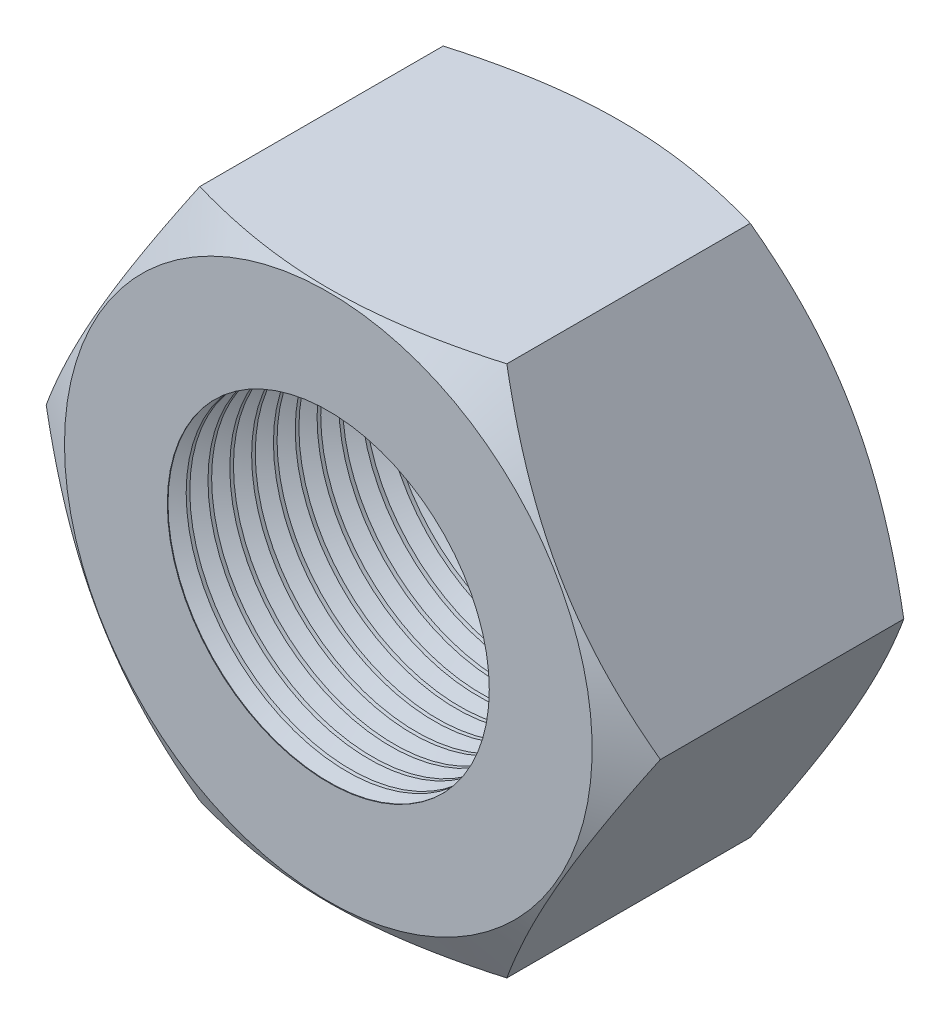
ISO-10303-21;
HEADER;
FILE_DESCRIPTION(('STEP AP214'),'2;1');
FILE_NAME('part.step','',(''),(''),'','','');
FILE_SCHEMA(('AUTOMOTIVE_DESIGN { 1 0 10303 214 1 1 1 1 }'));
ENDSEC;
DATA;
#1=APPLICATION_CONTEXT('core data for automotive mechanical design processes');
#2=APPLICATION_PROTOCOL_DEFINITION('international standard','automotive_design',2000,#1);
#3=PRODUCT_CONTEXT('',#1,'mechanical');
#4=PRODUCT('Part','Part','',(#3));
#5=PRODUCT_RELATED_PRODUCT_CATEGORY('part','',(#4));
#6=PRODUCT_DEFINITION_FORMATION('','',#4);
#7=PRODUCT_DEFINITION_CONTEXT('part definition',#1,'design');
#8=PRODUCT_DEFINITION('design','',#6,#7);
#9=PRODUCT_DEFINITION_SHAPE('','',#8);
#10=(LENGTH_UNIT() NAMED_UNIT(*) SI_UNIT(.MILLI.,.METRE.));
#11=(NAMED_UNIT(*) PLANE_ANGLE_UNIT() SI_UNIT($,.RADIAN.));
#12=(NAMED_UNIT(*) SI_UNIT($,.STERADIAN.) SOLID_ANGLE_UNIT());
#13=UNCERTAINTY_MEASURE_WITH_UNIT(LENGTH_MEASURE(1.E-05),#10,'distance_accuracy_value','');
#14=(GEOMETRIC_REPRESENTATION_CONTEXT(3) GLOBAL_UNCERTAINTY_ASSIGNED_CONTEXT((#13)) GLOBAL_UNIT_ASSIGNED_CONTEXT((#10,
#11,#12)) REPRESENTATION_CONTEXT('',''));
#15=CARTESIAN_POINT('',(0.,0.,0.));
#16=DIRECTION('',(0.,0.,1.));
#17=DIRECTION('',(1.,0.,0.));
#18=AXIS2_PLACEMENT_3D('',#15,#16,#17);
#19=CARTESIAN_POINT('',(0.,0.,-52.4));
#20=DIRECTION('',(0.,0.,1.));
#21=DIRECTION('',(1.,0.,0.));
#22=AXIS2_PLACEMENT_3D('',#19,#20,#21);
#23=CYLINDRICAL_SURFACE('',#22,28.7525);
#24=CARTESIAN_POINT('',(0.,0.,-3.36275));
#25=DIRECTION('',(0.,0.,1.));
#26=DIRECTION('',(1.,0.,0.));
#27=AXIS2_PLACEMENT_3D('',#24,#25,#26);
#28=CIRCLE('',#27,28.7525);
#29=CARTESIAN_POINT('',(28.7525,0.,-3.36275));
#30=VERTEX_POINT('',#29);
#31=EDGE_CURVE('E381',#30,#30,#28,.T.);
#32=ORIENTED_EDGE('',*,*,#31,.T.);
#33=EDGE_LOOP('',(#32));
#34=FACE_BOUND('',#33,.T.);
#35=CARTESIAN_POINT('',(0.,0.,-4.01225));
#36=DIRECTION('',(0.,0.,1.));
#37=DIRECTION('',(1.,0.,0.));
#38=AXIS2_PLACEMENT_3D('',#35,#36,#37);
#39=CIRCLE('',#38,28.7525);
#40=CARTESIAN_POINT('',(28.7525,0.,-4.01225));
#41=VERTEX_POINT('',#40);
#42=EDGE_CURVE('E375',#41,#41,#39,.T.);
#43=ORIENTED_EDGE('',*,*,#42,.F.);
#44=EDGE_LOOP('',(#43));
#45=FACE_BOUND('',#44,.T.);
#46=ADVANCED_FACE('F35',(#34,#45),#23,.F.);
#47=CARTESIAN_POINT('',(0.,0.,-7.25975));
#48=DIRECTION('',(0.,0.,1.));
#49=DIRECTION('',(1.,0.,0.));
#50=AXIS2_PLACEMENT_3D('',#47,#48,#49);
#51=CIRCLE('',#50,28.7525);
#52=CARTESIAN_POINT('',(28.7525,0.,-7.25975));
#53=VERTEX_POINT('',#52);
#54=EDGE_CURVE('E372',#53,#53,#51,.T.);
#55=ORIENTED_EDGE('',*,*,#54,.T.);
#56=EDGE_LOOP('',(#55));
#57=FACE_BOUND('',#56,.T.);
#58=CARTESIAN_POINT('',(0.,0.,-7.90925000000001));
#59=DIRECTION('',(0.,0.,1.));
#60=DIRECTION('',(1.,0.,0.));
#61=AXIS2_PLACEMENT_3D('',#58,#59,#60);
#62=CIRCLE('',#61,28.7525);
#63=CARTESIAN_POINT('',(28.7525,0.,-7.90925000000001));
#64=VERTEX_POINT('',#63);
#65=EDGE_CURVE('E366',#64,#64,#62,.T.);
#66=ORIENTED_EDGE('',*,*,#65,.F.);
#67=EDGE_LOOP('',(#66));
#68=FACE_BOUND('',#67,.T.);
#69=ADVANCED_FACE('F235',(#57,#68),#23,.F.);
#70=CARTESIAN_POINT('',(0.,0.,-11.15675));
#71=DIRECTION('',(0.,0.,1.));
#72=DIRECTION('',(1.,0.,0.));
#73=AXIS2_PLACEMENT_3D('',#70,#71,#72);
#74=CIRCLE('',#73,28.7525);
#75=CARTESIAN_POINT('',(28.7525,0.,-11.15675));
#76=VERTEX_POINT('',#75);
#77=EDGE_CURVE('E363',#76,#76,#74,.T.);
#78=ORIENTED_EDGE('',*,*,#77,.T.);
#79=EDGE_LOOP('',(#78));
#80=FACE_BOUND('',#79,.T.);
#81=CARTESIAN_POINT('',(0.,0.,-11.80625));
#82=DIRECTION('',(0.,0.,1.));
#83=DIRECTION('',(1.,0.,0.));
#84=AXIS2_PLACEMENT_3D('',#81,#82,#83);
#85=CIRCLE('',#84,28.7525);
#86=CARTESIAN_POINT('',(28.7525,0.,-11.80625));
#87=VERTEX_POINT('',#86);
#88=EDGE_CURVE('E357',#87,#87,#85,.T.);
#89=ORIENTED_EDGE('',*,*,#88,.F.);
#90=EDGE_LOOP('',(#89));
#91=FACE_BOUND('',#90,.T.);
#92=ADVANCED_FACE('F240',(#80,#91),#23,.F.);
#93=CARTESIAN_POINT('',(0.,0.,-15.05375));
#94=DIRECTION('',(0.,0.,1.));
#95=DIRECTION('',(1.,0.,0.));
#96=AXIS2_PLACEMENT_3D('',#93,#94,#95);
#97=CIRCLE('',#96,28.7525);
#98=CARTESIAN_POINT('',(28.7525,0.,-15.05375));
#99=VERTEX_POINT('',#98);
#100=EDGE_CURVE('E354',#99,#99,#97,.T.);
#101=ORIENTED_EDGE('',*,*,#100,.T.);
#102=EDGE_LOOP('',(#101));
#103=FACE_BOUND('',#102,.T.);
#104=CARTESIAN_POINT('',(0.,0.,-15.70325));
#105=DIRECTION('',(0.,0.,1.));
#106=DIRECTION('',(1.,0.,0.));
#107=AXIS2_PLACEMENT_3D('',#104,#105,#106);
#108=CIRCLE('',#107,28.7525);
#109=CARTESIAN_POINT('',(28.7525,0.,-15.70325));
#110=VERTEX_POINT('',#109);
#111=EDGE_CURVE('E348',#110,#110,#108,.T.);
#112=ORIENTED_EDGE('',*,*,#111,.F.);
#113=EDGE_LOOP('',(#112));
#114=FACE_BOUND('',#113,.T.);
#115=ADVANCED_FACE('F589',(#103,#114),#23,.F.);
#116=CARTESIAN_POINT('',(0.,0.,-18.95075));
#117=DIRECTION('',(0.,0.,1.));
#118=DIRECTION('',(1.,0.,0.));
#119=AXIS2_PLACEMENT_3D('',#116,#117,#118);
#120=CIRCLE('',#119,28.7525);
#121=CARTESIAN_POINT('',(28.7525,0.,-18.95075));
#122=VERTEX_POINT('',#121);
#123=EDGE_CURVE('E345',#122,#122,#120,.T.);
#124=ORIENTED_EDGE('',*,*,#123,.T.);
#125=EDGE_LOOP('',(#124));
#126=FACE_BOUND('',#125,.T.);
#127=CARTESIAN_POINT('',(0.,0.,-19.60025));
#128=DIRECTION('',(0.,0.,1.));
#129=DIRECTION('',(1.,0.,0.));
#130=AXIS2_PLACEMENT_3D('',#127,#128,#129);
#131=CIRCLE('',#130,28.7525);
#132=CARTESIAN_POINT('',(28.7525,0.,-19.60025));
#133=VERTEX_POINT('',#132);
#134=EDGE_CURVE('E339',#133,#133,#131,.T.);
#135=ORIENTED_EDGE('',*,*,#134,.F.);
#136=EDGE_LOOP('',(#135));
#137=FACE_BOUND('',#136,.T.);
#138=ADVANCED_FACE('F599',(#126,#137),#23,.F.);
#139=CARTESIAN_POINT('',(0.,0.,-22.84775));
#140=DIRECTION('',(0.,0.,1.));
#141=DIRECTION('',(1.,0.,0.));
#142=AXIS2_PLACEMENT_3D('',#139,#140,#141);
#143=CIRCLE('',#142,28.7525);
#144=CARTESIAN_POINT('',(28.7525,0.,-22.84775));
#145=VERTEX_POINT('',#144);
#146=EDGE_CURVE('E336',#145,#145,#143,.T.);
#147=ORIENTED_EDGE('',*,*,#146,.T.);
#148=EDGE_LOOP('',(#147));
#149=FACE_BOUND('',#148,.T.);
#150=CARTESIAN_POINT('',(0.,0.,-23.49725));
#151=DIRECTION('',(0.,0.,1.));
#152=DIRECTION('',(1.,0.,0.));
#153=AXIS2_PLACEMENT_3D('',#150,#151,#152);
#154=CIRCLE('',#153,28.7525);
#155=CARTESIAN_POINT('',(28.7525,0.,-23.49725));
#156=VERTEX_POINT('',#155);
#157=EDGE_CURVE('E330',#156,#156,#154,.T.);
#158=ORIENTED_EDGE('',*,*,#157,.F.);
#159=EDGE_LOOP('',(#158));
#160=FACE_BOUND('',#159,.T.);
#161=ADVANCED_FACE('F609',(#149,#160),#23,.F.);
#162=CARTESIAN_POINT('',(0.,0.,-26.74475));
#163=DIRECTION('',(0.,0.,1.));
#164=DIRECTION('',(1.,0.,0.));
#165=AXIS2_PLACEMENT_3D('',#162,#163,#164);
#166=CIRCLE('',#165,28.7525);
#167=CARTESIAN_POINT('',(28.7525,0.,-26.74475));
#168=VERTEX_POINT('',#167);
#169=EDGE_CURVE('E327',#168,#168,#166,.T.);
#170=ORIENTED_EDGE('',*,*,#169,.T.);
#171=EDGE_LOOP('',(#170));
#172=FACE_BOUND('',#171,.T.);
#173=CARTESIAN_POINT('',(0.,0.,-27.39425));
#174=DIRECTION('',(0.,0.,1.));
#175=DIRECTION('',(1.,0.,0.));
#176=AXIS2_PLACEMENT_3D('',#173,#174,#175);
#177=CIRCLE('',#176,28.7525);
#178=CARTESIAN_POINT('',(28.7525,0.,-27.39425));
#179=VERTEX_POINT('',#178);
#180=EDGE_CURVE('E321',#179,#179,#177,.T.);
#181=ORIENTED_EDGE('',*,*,#180,.F.);
#182=EDGE_LOOP('',(#181));
#183=FACE_BOUND('',#182,.T.);
#184=ADVANCED_FACE('F619',(#172,#183),#23,.F.);
#185=CARTESIAN_POINT('',(0.,0.,-30.64175));
#186=DIRECTION('',(0.,0.,1.));
#187=DIRECTION('',(1.,0.,0.));
#188=AXIS2_PLACEMENT_3D('',#185,#186,#187);
#189=CIRCLE('',#188,28.7525);
#190=CARTESIAN_POINT('',(28.7525,0.,-30.64175));
#191=VERTEX_POINT('',#190);
#192=EDGE_CURVE('E318',#191,#191,#189,.T.);
#193=ORIENTED_EDGE('',*,*,#192,.T.);
#194=EDGE_LOOP('',(#193));
#195=FACE_BOUND('',#194,.T.);
#196=CARTESIAN_POINT('',(0.,0.,-31.29125));
#197=DIRECTION('',(0.,0.,1.));
#198=DIRECTION('',(1.,0.,0.));
#199=AXIS2_PLACEMENT_3D('',#196,#197,#198);
#200=CIRCLE('',#199,28.7525);
#201=CARTESIAN_POINT('',(28.7525,0.,-31.29125));
#202=VERTEX_POINT('',#201);
#203=EDGE_CURVE('E312',#202,#202,#200,.T.);
#204=ORIENTED_EDGE('',*,*,#203,.F.);
#205=EDGE_LOOP('',(#204));
#206=FACE_BOUND('',#205,.T.);
#207=ADVANCED_FACE('F629',(#195,#206),#23,.F.);
#208=CARTESIAN_POINT('',(0.,0.,-34.53875));
#209=DIRECTION('',(0.,0.,1.));
#210=DIRECTION('',(1.,0.,0.));
#211=AXIS2_PLACEMENT_3D('',#208,#209,#210);
#212=CIRCLE('',#211,28.7525);
#213=CARTESIAN_POINT('',(28.7525,0.,-34.53875));
#214=VERTEX_POINT('',#213);
#215=EDGE_CURVE('E309',#214,#214,#212,.T.);
#216=ORIENTED_EDGE('',*,*,#215,.T.);
#217=EDGE_LOOP('',(#216));
#218=FACE_BOUND('',#217,.T.);
#219=CARTESIAN_POINT('',(0.,0.,-35.18825));
#220=DIRECTION('',(0.,0.,1.));
#221=DIRECTION('',(1.,0.,0.));
#222=AXIS2_PLACEMENT_3D('',#219,#220,#221);
#223=CIRCLE('',#222,28.7525);
#224=CARTESIAN_POINT('',(28.7525,0.,-35.18825));
#225=VERTEX_POINT('',#224);
#226=EDGE_CURVE('E303',#225,#225,#223,.T.);
#227=ORIENTED_EDGE('',*,*,#226,.F.);
#228=EDGE_LOOP('',(#227));
#229=FACE_BOUND('',#228,.T.);
#230=ADVANCED_FACE('F639',(#218,#229),#23,.F.);
#231=CARTESIAN_POINT('',(0.,0.,-38.43575));
#232=DIRECTION('',(0.,0.,1.));
#233=DIRECTION('',(1.,0.,0.));
#234=AXIS2_PLACEMENT_3D('',#231,#232,#233);
#235=CIRCLE('',#234,28.7525);
#236=CARTESIAN_POINT('',(28.7525,0.,-38.43575));
#237=VERTEX_POINT('',#236);
#238=EDGE_CURVE('E300',#237,#237,#235,.T.);
#239=ORIENTED_EDGE('',*,*,#238,.T.);
#240=EDGE_LOOP('',(#239));
#241=FACE_BOUND('',#240,.T.);
#242=CARTESIAN_POINT('',(0.,0.,-39.08525));
#243=DIRECTION('',(0.,0.,1.));
#244=DIRECTION('',(1.,0.,0.));
#245=AXIS2_PLACEMENT_3D('',#242,#243,#244);
#246=CIRCLE('',#245,28.7525);
#247=CARTESIAN_POINT('',(28.7525,0.,-39.08525));
#248=VERTEX_POINT('',#247);
#249=EDGE_CURVE('E294',#248,#248,#246,.T.);
#250=ORIENTED_EDGE('',*,*,#249,.F.);
#251=EDGE_LOOP('',(#250));
#252=FACE_BOUND('',#251,.T.);
#253=ADVANCED_FACE('F649',(#241,#252),#23,.F.);
#254=CARTESIAN_POINT('',(0.,0.,-42.33275));
#255=DIRECTION('',(0.,0.,1.));
#256=DIRECTION('',(1.,0.,0.));
#257=AXIS2_PLACEMENT_3D('',#254,#255,#256);
#258=CIRCLE('',#257,28.7525);
#259=CARTESIAN_POINT('',(28.7525,0.,-42.33275));
#260=VERTEX_POINT('',#259);
#261=EDGE_CURVE('E291',#260,#260,#258,.T.);
#262=ORIENTED_EDGE('',*,*,#261,.T.);
#263=EDGE_LOOP('',(#262));
#264=FACE_BOUND('',#263,.T.);
#265=CARTESIAN_POINT('',(0.,0.,-42.98225));
#266=DIRECTION('',(0.,0.,1.));
#267=DIRECTION('',(1.,0.,0.));
#268=AXIS2_PLACEMENT_3D('',#265,#266,#267);
#269=CIRCLE('',#268,28.7525);
#270=CARTESIAN_POINT('',(28.7525,0.,-42.98225));
#271=VERTEX_POINT('',#270);
#272=EDGE_CURVE('E285',#271,#271,#269,.T.);
#273=ORIENTED_EDGE('',*,*,#272,.F.);
#274=EDGE_LOOP('',(#273));
#275=FACE_BOUND('',#274,.T.);
#276=ADVANCED_FACE('F259',(#264,#275),#23,.F.);
#277=CARTESIAN_POINT('',(0.,0.,-46.22975));
#278=DIRECTION('',(0.,0.,1.));
#279=DIRECTION('',(1.,0.,0.));
#280=AXIS2_PLACEMENT_3D('',#277,#278,#279);
#281=CIRCLE('',#280,28.7525);
#282=CARTESIAN_POINT('',(28.7525,0.,-46.22975));
#283=VERTEX_POINT('',#282);
#284=EDGE_CURVE('E282',#283,#283,#281,.T.);
#285=ORIENTED_EDGE('',*,*,#284,.T.);
#286=EDGE_LOOP('',(#285));
#287=FACE_BOUND('',#286,.T.);
#288=CARTESIAN_POINT('',(0.,0.,-46.87925));
#289=DIRECTION('',(0.,0.,1.));
#290=DIRECTION('',(1.,0.,0.));
#291=AXIS2_PLACEMENT_3D('',#288,#289,#290);
#292=CIRCLE('',#291,28.7525);
#293=CARTESIAN_POINT('',(28.7525,0.,-46.87925));
#294=VERTEX_POINT('',#293);
#295=EDGE_CURVE('E276',#294,#294,#292,.T.);
#296=ORIENTED_EDGE('',*,*,#295,.F.);
#297=EDGE_LOOP('',(#296));
#298=FACE_BOUND('',#297,.T.);
#299=ADVANCED_FACE('F253',(#287,#298),#23,.F.);
#300=CARTESIAN_POINT('',(0.,0.,-50.12675));
#301=DIRECTION('',(0.,0.,1.));
#302=DIRECTION('',(1.,0.,0.));
#303=AXIS2_PLACEMENT_3D('',#300,#301,#302);
#304=CIRCLE('',#303,28.7525);
#305=CARTESIAN_POINT('',(28.7525,0.,-50.12675));
#306=VERTEX_POINT('',#305);
#307=EDGE_CURVE('E264',#306,#306,#304,.T.);
#308=ORIENTED_EDGE('',*,*,#307,.T.);
#309=EDGE_LOOP('',(#308));
#310=FACE_BOUND('',#309,.T.);
#311=CARTESIAN_POINT('',(0.,0.,-50.77625));
#312=DIRECTION('',(0.,0.,1.));
#313=DIRECTION('',(1.,0.,0.));
#314=AXIS2_PLACEMENT_3D('',#311,#312,#313);
#315=CIRCLE('',#314,28.7525);
#316=CARTESIAN_POINT('',(28.7525,0.,-50.77625));
#317=VERTEX_POINT('',#316);
#318=EDGE_CURVE('E267',#317,#317,#315,.T.);
#319=ORIENTED_EDGE('',*,*,#318,.F.);
#320=EDGE_LOOP('',(#319));
#321=FACE_BOUND('',#320,.T.);
#322=ADVANCED_FACE('F246',(#310,#321),#23,.F.);
#323=CARTESIAN_POINT('',(-27.4241377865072,-47.5,-52.4));
#324=DIRECTION('',(0.,-1.,0.));
#325=DIRECTION('',(0.,0.,-1.));
#326=AXIS2_PLACEMENT_3D('',#323,#324,#325);
#327=PLANE('',#326);
#328=CARTESIAN_POINT('',(-72.7028294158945,-47.5,-22.9320115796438));
#329=CARTESIAN_POINT('',(-71.6602262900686,-47.5,-22.4281002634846));
#330=CARTESIAN_POINT('',(-70.6163611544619,-47.5,-21.926790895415));
#331=CARTESIAN_POINT('',(-68.5258423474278,-47.5,-20.9299922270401));
#332=CARTESIAN_POINT('',(-67.4791886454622,-47.5,-20.4345029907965));
#333=CARTESIAN_POINT('',(-65.3826729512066,-47.5,-19.4498881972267));
#334=CARTESIAN_POINT('',(-64.332810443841,-47.5,-18.9607637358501));
#335=CARTESIAN_POINT('',(-62.2297700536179,-47.5,-17.9896977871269));
#336=CARTESIAN_POINT('',(-61.1765921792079,-47.5,-17.5077562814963));
#337=CARTESIAN_POINT('',(-59.0605521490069,-47.5,-16.5491438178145));
#338=CARTESIAN_POINT('',(-57.997669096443,-47.5,-16.0725189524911));
#339=CARTESIAN_POINT('',(-55.8678805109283,-47.5,-15.1283447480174));
#340=CARTESIAN_POINT('',(-54.8009749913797,-47.5,-14.6607953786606));
#341=CARTESIAN_POINT('',(-52.6628018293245,-47.5,-13.7359041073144));
#342=CARTESIAN_POINT('',(-51.5915343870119,-47.5,-13.2785617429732));
#343=CARTESIAN_POINT('',(-49.4441719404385,-47.5,-12.3753412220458));
#344=CARTESIAN_POINT('',(-48.368076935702,-47.5,-11.929463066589));
#345=CARTESIAN_POINT('',(-46.1974290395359,-47.5,-11.0452709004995));
#346=CARTESIAN_POINT('',(-45.1028112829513,-47.5,-10.6071159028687));
#347=CARTESIAN_POINT('',(-42.9076773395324,-47.5,-9.74580988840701));
#348=CARTESIAN_POINT('',(-41.8071611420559,-47.5,-9.32265889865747));
#349=CARTESIAN_POINT('',(-39.5995822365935,-47.5,-8.49332231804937));
#350=CARTESIAN_POINT('',(-38.4925187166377,-47.5,-8.08713888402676));
#351=CARTESIAN_POINT('',(-36.2714841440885,-47.5,-7.29410275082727));
#352=CARTESIAN_POINT('',(-35.1575131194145,-47.5,-6.90724997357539));
#353=CARTESIAN_POINT('',(-32.9245627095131,-47.5,-6.15629628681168));
#354=CARTESIAN_POINT('',(-31.8055992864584,-47.5,-5.79214815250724));
#355=CARTESIAN_POINT('',(-29.559925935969,-47.5,-5.08865237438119));
#356=CARTESIAN_POINT('',(-28.4332158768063,-47.5,-4.74930515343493));
#357=CARTESIAN_POINT('',(-25.0414784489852,-47.5,-3.77344740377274));
#358=CARTESIAN_POINT('',(-22.7639825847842,-47.5,-3.17882608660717));
#359=CARTESIAN_POINT('',(-19.3233218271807,-47.5,-2.39266148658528));
#360=CARTESIAN_POINT('',(-18.1721145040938,-47.5,-2.14819320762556));
#361=CARTESIAN_POINT('',(-15.8620339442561,-47.5,-1.69837608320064));
#362=CARTESIAN_POINT('',(-14.7031608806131,-47.5,-1.49302635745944));
#363=CARTESIAN_POINT('',(-12.3785415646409,-47.5,-1.12508873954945));
#364=CARTESIAN_POINT('',(-11.2127948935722,-47.5,-0.962503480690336));
#365=CARTESIAN_POINT('',(-8.87576286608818,-47.5,-0.683361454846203));
#366=CARTESIAN_POINT('',(-7.70447750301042,-47.5,-0.566804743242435));
#367=CARTESIAN_POINT('',(-5.36549628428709,-47.5,-0.382855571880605));
#368=CARTESIAN_POINT('',(-4.19782471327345,-47.5,-0.315156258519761));
#369=CARTESIAN_POINT('',(-1.86066452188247,-47.5,-0.229279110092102));
#370=CARTESIAN_POINT('',(-0.691175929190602,-47.5,-0.211100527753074));
#371=CARTESIAN_POINT('',(1.64718127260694,-47.5,-0.224689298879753));
#372=CARTESIAN_POINT('',(2.81604996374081,-47.5,-0.256442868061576));
#373=CARTESIAN_POINT('',(5.1514660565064,-47.5,-0.369131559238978));
#374=CARTESIAN_POINT('',(6.31801335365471,-47.5,-0.450068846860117));
#375=CARTESIAN_POINT('',(8.3138971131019,-47.5,-0.629368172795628));
#376=CARTESIAN_POINT('',(9.14429847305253,-47.5,-0.716134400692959));
#377=CARTESIAN_POINT('',(10.8023622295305,-47.5,-0.912839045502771));
#378=CARTESIAN_POINT('',(11.6300245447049,-47.5,-1.02277814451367));
#379=CARTESIAN_POINT('',(14.1082995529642,-47.5,-1.38573503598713));
#380=CARTESIAN_POINT('',(15.7541395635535,-47.5,-1.67188681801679));
#381=CARTESIAN_POINT('',(19.0336161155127,-47.5,-2.32286064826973));
#382=CARTESIAN_POINT('',(20.6672185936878,-47.5,-2.68785138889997));
#383=CARTESIAN_POINT('',(23.9177227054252,-47.5,-3.48516015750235));
#384=CARTESIAN_POINT('',(25.5346249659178,-47.5,-3.91747564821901));
#385=CARTESIAN_POINT('',(28.7897163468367,-47.5,-4.84988819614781));
#386=CARTESIAN_POINT('',(30.4275152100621,-47.5,-5.35133725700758));
#387=CARTESIAN_POINT('',(33.6870930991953,-47.5,-6.40409579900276));
#388=CARTESIAN_POINT('',(35.3088706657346,-47.5,-6.95540977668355));
#389=CARTESIAN_POINT('',(37.7258768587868,-47.5,-7.81184429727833));
#390=CARTESIAN_POINT('',(38.5266848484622,-47.5,-8.10137005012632));
#391=CARTESIAN_POINT('',(40.1248612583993,-47.5,-8.6897940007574));
#392=CARTESIAN_POINT('',(40.922229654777,-47.5,-8.98869226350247));
#393=CARTESIAN_POINT('',(42.5134347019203,-47.5,-9.59492633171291));
#394=CARTESIAN_POINT('',(43.3072724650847,-47.5,-9.90225922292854));
#395=CARTESIAN_POINT('',(44.8918586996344,-47.5,-10.5247269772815));
#396=CARTESIAN_POINT('',(45.6826072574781,-47.5,-10.8398616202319));
#397=CARTESIAN_POINT('',(46.47191791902,-47.5,-11.1585392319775));
#398=B_SPLINE_CURVE_WITH_KNOTS('',3,(#328,#329,#330,#331,#332,#333,#334,#335,#336,#337,#338,
#339,#340,#341,#342,#343,#344,#345,#346,#347,#348,#349,#350,#351,#352,#353,#354,#355,#356,#357,
#358,#359,#360,#361,#362,#363,#364,#365,#366,#367,#368,#369,#370,#371,#372,#373,#374,#375,#376,
#377,#378,#379,#380,#381,#382,#383,#384,#385,#386,#387,#388,#389,#390,#391,#392,#393,#394,#395,
#396,#397),.UNSPECIFIED.,.F.,.F.,(4,2,2,2,2,2,2,2,2,2,2,2,2,2,2,2,2,2,2,2,2,2,2,2,2,2,2,2,2,2,2,
2,2,2,4),(0.,3.47398144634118,6.94800109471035,10.4226112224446,13.8972125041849,
17.3917454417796,20.8862667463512,24.3806294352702,27.8749924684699,31.4120560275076,
34.9491259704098,38.4866441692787,42.0241480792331,45.5540301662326,49.0839724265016,
56.1411284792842,59.6712294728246,63.2012510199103,66.7314898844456,70.2617329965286,
73.7696064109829,77.2774268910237,80.7842791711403,84.2912858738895,86.7957298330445,
89.3002475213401,94.3094656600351,99.3295101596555,104.349365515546,109.486963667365,
114.62502556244,117.179597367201,119.734186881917,122.287904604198,124.841550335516),.UNSPECIFIED.);
#399=CARTESIAN_POINT('',(-27.4241377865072,-47.5,-4.45903523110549));
#400=VERTEX_POINT('',#399);
#401=CARTESIAN_POINT('',(27.4241377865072,-47.5,-4.45903523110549));
#402=VERTEX_POINT('',#401);
#403=EDGE_CURVE('E53',#400,#402,#398,.T.);
#404=ORIENTED_EDGE('',*,*,#403,.F.);
#405=DIRECTION('',(0.,0.,1.));
#406=VECTOR('',#405,1.);
#407=CARTESIAN_POINT('',(-27.4241377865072,-47.5,-52.4));
#408=LINE('',#407,#406);
#409=CARTESIAN_POINT('',(-27.4241377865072,-47.5,-47.9409647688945));
#410=VERTEX_POINT('',#409);
#411=EDGE_CURVE('E11',#410,#400,#408,.T.);
#412=ORIENTED_EDGE('',*,*,#411,.F.);
#413=CARTESIAN_POINT('',(-72.7028294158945,-47.5,-29.4679884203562));
#414=CARTESIAN_POINT('',(-71.6602262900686,-47.5,-29.9718997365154));
#415=CARTESIAN_POINT('',(-70.6163611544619,-47.5,-30.473209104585));
#416=CARTESIAN_POINT('',(-68.5258423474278,-47.5,-31.4700077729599));
#417=CARTESIAN_POINT('',(-67.4791886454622,-47.5,-31.9654970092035));
#418=CARTESIAN_POINT('',(-65.3826729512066,-47.5,-32.9501118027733));
#419=CARTESIAN_POINT('',(-64.3328104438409,-47.5,-33.4392362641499));
#420=CARTESIAN_POINT('',(-62.2297700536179,-47.5,-34.4103022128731));
#421=CARTESIAN_POINT('',(-61.1765921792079,-47.5,-34.8922437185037));
#422=CARTESIAN_POINT('',(-59.0605521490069,-47.5,-35.8508561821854));
#423=CARTESIAN_POINT('',(-57.997669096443,-47.5,-36.3274810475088));
#424=CARTESIAN_POINT('',(-55.8678805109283,-47.5,-37.2716552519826));
#425=CARTESIAN_POINT('',(-54.8009749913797,-47.5,-37.7392046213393));
#426=CARTESIAN_POINT('',(-52.6628018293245,-47.5,-38.6640958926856));
#427=CARTESIAN_POINT('',(-51.5915343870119,-47.5,-39.1214382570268));
#428=CARTESIAN_POINT('',(-49.4441719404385,-47.5,-40.0246587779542));
#429=CARTESIAN_POINT('',(-48.368076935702,-47.5,-40.470536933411));
#430=CARTESIAN_POINT('',(-46.1974290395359,-47.5,-41.3547290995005));
#431=CARTESIAN_POINT('',(-45.1028112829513,-47.5,-41.7928840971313));
#432=CARTESIAN_POINT('',(-42.9076773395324,-47.5,-42.654190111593));
#433=CARTESIAN_POINT('',(-41.8071611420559,-47.5,-43.0773411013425));
#434=CARTESIAN_POINT('',(-39.5995822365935,-47.5,-43.9066776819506));
#435=CARTESIAN_POINT('',(-38.4925187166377,-47.5,-44.3128611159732));
#436=CARTESIAN_POINT('',(-36.2714841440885,-47.5,-45.1058972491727));
#437=CARTESIAN_POINT('',(-35.1575131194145,-47.5,-45.4927500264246));
#438=CARTESIAN_POINT('',(-32.9245627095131,-47.5,-46.2437037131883));
#439=CARTESIAN_POINT('',(-31.8055992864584,-47.5,-46.6078518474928));
#440=CARTESIAN_POINT('',(-29.559925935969,-47.5,-47.3113476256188));
#441=CARTESIAN_POINT('',(-28.4332158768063,-47.5,-47.6506948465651));
#442=CARTESIAN_POINT('',(-25.0414784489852,-47.5,-48.6265525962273));
#443=CARTESIAN_POINT('',(-22.7639825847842,-47.5,-49.2211739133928));
#444=CARTESIAN_POINT('',(-19.3233218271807,-47.5,-50.0073385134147));
#445=CARTESIAN_POINT('',(-18.1721145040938,-47.5,-50.2518067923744));
#446=CARTESIAN_POINT('',(-15.8620339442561,-47.5,-50.7016239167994));
#447=CARTESIAN_POINT('',(-14.7031608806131,-47.5,-50.9069736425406));
#448=CARTESIAN_POINT('',(-12.3785415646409,-47.5,-51.2749112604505));
#449=CARTESIAN_POINT('',(-11.2127948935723,-47.5,-51.4374965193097));
#450=CARTESIAN_POINT('',(-8.87576286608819,-47.5,-51.7166385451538));
#451=CARTESIAN_POINT('',(-7.70447750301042,-47.5,-51.8331952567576));
#452=CARTESIAN_POINT('',(-5.3654962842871,-47.5,-52.0171444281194));
#453=CARTESIAN_POINT('',(-4.19782471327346,-47.5,-52.0848437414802));
#454=CARTESIAN_POINT('',(-1.86066452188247,-47.5,-52.1707208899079));
#455=CARTESIAN_POINT('',(-0.691175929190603,-47.5,-52.1888994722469));
#456=CARTESIAN_POINT('',(1.64718127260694,-47.5,-52.1753107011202));
#457=CARTESIAN_POINT('',(2.81604996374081,-47.5,-52.1435571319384));
#458=CARTESIAN_POINT('',(5.1514660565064,-47.5,-52.030868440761));
#459=CARTESIAN_POINT('',(6.31801335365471,-47.5,-51.9499311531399));
#460=CARTESIAN_POINT('',(8.31389711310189,-47.5,-51.7706318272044));
#461=CARTESIAN_POINT('',(9.14429847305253,-47.5,-51.683865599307));
#462=CARTESIAN_POINT('',(10.8023622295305,-47.5,-51.4871609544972));
#463=CARTESIAN_POINT('',(11.6300245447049,-47.5,-51.3772218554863));
#464=CARTESIAN_POINT('',(14.1082995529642,-47.5,-51.0142649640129));
#465=CARTESIAN_POINT('',(15.7541395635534,-47.5,-50.7281131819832));
#466=CARTESIAN_POINT('',(19.0336161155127,-47.5,-50.0771393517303));
#467=CARTESIAN_POINT('',(20.6672185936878,-47.5,-49.7121486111));
#468=CARTESIAN_POINT('',(23.9177227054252,-47.5,-48.9148398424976));
#469=CARTESIAN_POINT('',(25.5346249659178,-47.5,-48.482524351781));
#470=CARTESIAN_POINT('',(28.7897163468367,-47.5,-47.5501118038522));
#471=CARTESIAN_POINT('',(30.4275152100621,-47.5,-47.0486627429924));
#472=CARTESIAN_POINT('',(33.6870930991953,-47.5,-45.9959042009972));
#473=CARTESIAN_POINT('',(35.3088706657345,-47.5,-45.4445902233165));
#474=CARTESIAN_POINT('',(37.7258768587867,-47.5,-44.5881557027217));
#475=CARTESIAN_POINT('',(38.5266848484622,-47.5,-44.2986299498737));
#476=CARTESIAN_POINT('',(40.1248612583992,-47.5,-43.7102059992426));
#477=CARTESIAN_POINT('',(40.922229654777,-47.5,-43.4113077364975));
#478=CARTESIAN_POINT('',(42.5134347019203,-47.5,-42.8050736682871));
#479=CARTESIAN_POINT('',(43.3072724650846,-47.5,-42.4977407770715));
#480=CARTESIAN_POINT('',(44.8918586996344,-47.5,-41.8752730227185));
#481=CARTESIAN_POINT('',(45.6826072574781,-47.5,-41.5601383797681));
#482=CARTESIAN_POINT('',(46.4719179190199,-47.5,-41.2414607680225));
#483=B_SPLINE_CURVE_WITH_KNOTS('',3,(#413,#414,#415,#416,#417,#418,#419,#420,#421,#422,#423,
#424,#425,#426,#427,#428,#429,#430,#431,#432,#433,#434,#435,#436,#437,#438,#439,#440,#441,#442,
#443,#444,#445,#446,#447,#448,#449,#450,#451,#452,#453,#454,#455,#456,#457,#458,#459,#460,#461,
#462,#463,#464,#465,#466,#467,#468,#469,#470,#471,#472,#473,#474,#475,#476,#477,#478,#479,#480,
#481,#482),.UNSPECIFIED.,.F.,.F.,(4,2,2,2,2,2,2,2,2,2,2,2,2,2,2,2,2,2,2,2,2,2,2,2,2,2,2,2,2,2,2,
2,2,2,4),(0.,3.47398144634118,6.94800109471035,10.4226112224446,13.8972125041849,
17.3917454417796,20.8862667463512,24.3806294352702,27.8749924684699,31.4120560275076,
34.9491259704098,38.4866441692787,42.0241480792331,45.5540301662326,49.0839724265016,
56.1411284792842,59.6712294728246,63.2012510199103,66.7314898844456,70.2617329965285,
73.7696064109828,77.2774268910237,80.7842791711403,84.2912858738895,86.7957298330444,
89.3002475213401,94.3094656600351,99.3295101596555,104.349365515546,109.486963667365,
114.62502556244,117.179597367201,119.734186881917,122.287904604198,124.841550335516),.UNSPECIFIED.);
#484=CARTESIAN_POINT('',(27.4241377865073,-47.5,-47.9409647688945));
#485=VERTEX_POINT('',#484);
#486=EDGE_CURVE('E127',#485,#410,#483,.F.);
#487=ORIENTED_EDGE('',*,*,#486,.F.);
#488=DIRECTION('',(0.,0.,1.));
#489=VECTOR('',#488,1.);
#490=CARTESIAN_POINT('',(27.4241377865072,-47.5,-52.4));
#491=LINE('',#490,#489);
#492=EDGE_CURVE('E40',#485,#402,#491,.T.);
#493=ORIENTED_EDGE('',*,*,#492,.T.);
#494=EDGE_LOOP('',(#404,#412,#487,#493));
#495=FACE_BOUND('',#494,.T.);
#496=ADVANCED_FACE('F37',(#495),#327,.T.);
#497=CARTESIAN_POINT('',(-54.8482755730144,0.,-52.4));
#498=DIRECTION('',(-0.866025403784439,-0.5,0.));
#499=DIRECTION('',(0.5,-0.866025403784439,0.));
#500=AXIS2_PLACEMENT_3D('',#497,#498,#499);
#501=PLANE('',#500);
#502=CARTESIAN_POINT('',(-54.8483910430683,0.000200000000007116,-4.45910189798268));
#503=CARTESIAN_POINT('',(-54.2456213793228,-1.04382768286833,-4.11112021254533));
#504=CARTESIAN_POINT('',(-53.6405005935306,-2.09192762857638,-3.77892970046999));
#505=CARTESIAN_POINT('',(-52.4254066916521,-4.19653200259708,-3.15052035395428));
#506=CARTESIAN_POINT('',(-51.8154320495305,-5.25303907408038,-2.85431335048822));
#507=CARTESIAN_POINT('',(-50.5894386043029,-7.37652201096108,-2.30184685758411));
#508=CARTESIAN_POINT('',(-49.9734089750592,-8.44351662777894,-2.04568276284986));
#509=CARTESIAN_POINT('',(-48.7370953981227,-10.5848745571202,-1.57882045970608));
#510=CARTESIAN_POINT('',(-48.1168118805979,-11.6592371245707,-1.36811772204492));
#511=CARTESIAN_POINT('',(-46.8878453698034,-13.7878695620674,-1.0011221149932));
#512=CARTESIAN_POINT('',(-46.2792535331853,-14.8419815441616,-0.843615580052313));
#513=CARTESIAN_POINT('',(-45.0592812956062,-16.955035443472,-0.579514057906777));
#514=CARTESIAN_POINT('',(-44.447900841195,-18.0139774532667,-0.472920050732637));
#515=CARTESIAN_POINT('',(-43.2241130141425,-20.1336401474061,-0.31333499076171));
#516=CARTESIAN_POINT('',(-42.6117077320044,-21.1943572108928,-0.260280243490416));
#517=CARTESIAN_POINT('',(-41.3863319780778,-23.3167702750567,-0.20891474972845));
#518=CARTESIAN_POINT('',(-40.7733615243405,-24.3784662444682,-0.21060231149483));
#519=CARTESIAN_POINT('',(-39.6274115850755,-26.3633097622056,-0.264896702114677));
#520=CARTESIAN_POINT('',(-39.0943504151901,-27.2865987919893,-0.310882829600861));
#521=CARTESIAN_POINT('',(-38.0294993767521,-29.1309748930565,-0.443383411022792));
#522=CARTESIAN_POINT('',(-37.4977094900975,-30.0520619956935,-0.529897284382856));
#523=CARTESIAN_POINT('',(-36.4356037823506,-31.89168304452,-0.741948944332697));
#524=CARTESIAN_POINT('',(-35.9052897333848,-32.8102139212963,-0.867522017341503));
#525=CARTESIAN_POINT('',(-34.8471822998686,-34.6429097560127,-1.15548874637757));
#526=CARTESIAN_POINT('',(-34.31938890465,-35.5570747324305,-1.31788224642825));
#527=CARTESIAN_POINT('',(-33.2551175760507,-37.4004467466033,-1.68088733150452));
#528=CARTESIAN_POINT('',(-32.7187051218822,-38.3295403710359,-1.88226343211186));
#529=CARTESIAN_POINT('',(-31.6491632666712,-40.1820412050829,-2.31786110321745));
#530=CARTESIAN_POINT('',(-31.1160343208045,-41.1054476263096,-2.55208712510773));
#531=CARTESIAN_POINT('',(-30.05430958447,-42.9444088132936,-3.04984014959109));
#532=CARTESIAN_POINT('',(-29.5257070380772,-43.8599752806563,-3.31330981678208));
#533=CARTESIAN_POINT('',(-28.4721580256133,-45.6847756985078,-3.86692168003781));
#534=CARTESIAN_POINT('',(-27.9472105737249,-46.5940113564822,-4.15705635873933));
#535=CARTESIAN_POINT('',(-27.4240223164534,-47.5002,-4.45910189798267));
#536=B_SPLINE_CURVE_WITH_KNOTS('',3,(#502,#503,#504,#505,#506,#507,#508,#509,#510,#511,#512,
#513,#514,#515,#516,#517,#518,#519,#520,#521,#522,#523,#524,#525,#526,#527,#528,#529,#530,#531,
#532,#533,#534,#535),.UNSPECIFIED.,.F.,.F.,(4,2,2,2,2,2,2,2,2,2,2,2,2,2,2,2,4),(0.,
3.76437091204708,7.52997617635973,11.3044198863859,15.078487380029,18.7594820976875,
22.4405476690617,26.1172287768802,29.7937962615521,32.9943659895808,36.1948898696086,
39.3983135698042,42.6017237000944,45.8758477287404,49.1504158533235,52.4186735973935,
55.6860127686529),.UNSPECIFIED.);
#537=CARTESIAN_POINT('',(-54.8482755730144,0.,-4.45903523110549));
#538=VERTEX_POINT('',#537);
#539=EDGE_CURVE('E93',#538,#400,#536,.T.);
#540=ORIENTED_EDGE('',*,*,#539,.F.);
#541=DIRECTION('',(0.,0.,1.));
#542=VECTOR('',#541,1.);
#543=CARTESIAN_POINT('',(-54.8482755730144,0.,-52.4));
#544=LINE('',#543,#542);
#545=CARTESIAN_POINT('',(-54.8482755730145,0.,-47.9409647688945));
#546=VERTEX_POINT('',#545);
#547=EDGE_CURVE('E45',#546,#538,#544,.T.);
#548=ORIENTED_EDGE('',*,*,#547,.F.);
#549=CARTESIAN_POINT('',(-27.4240223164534,-47.5002,-47.9408981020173));
#550=CARTESIAN_POINT('',(-28.0267919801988,-46.4561723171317,-48.2888797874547));
#551=CARTESIAN_POINT('',(-28.631912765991,-45.4080723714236,-48.62107029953));
#552=CARTESIAN_POINT('',(-29.8470066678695,-43.3034679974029,-49.2494796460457));
#553=CARTESIAN_POINT('',(-30.4569813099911,-42.2469609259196,-49.5456866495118));
#554=CARTESIAN_POINT('',(-31.6829747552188,-40.1234779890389,-50.0981531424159));
#555=CARTESIAN_POINT('',(-32.2990043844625,-39.056483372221,-50.3543172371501));
#556=CARTESIAN_POINT('',(-33.535317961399,-36.9151254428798,-50.8211795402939));
#557=CARTESIAN_POINT('',(-34.1556014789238,-35.8407628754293,-51.0318822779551));
#558=CARTESIAN_POINT('',(-35.3845679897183,-33.7121304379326,-51.3988778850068));
#559=CARTESIAN_POINT('',(-35.9931598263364,-32.6580184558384,-51.5563844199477));
#560=CARTESIAN_POINT('',(-37.2131320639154,-30.544964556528,-51.8204859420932));
#561=CARTESIAN_POINT('',(-37.8245125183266,-29.4860225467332,-51.9270799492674));
#562=CARTESIAN_POINT('',(-39.0483003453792,-27.3663598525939,-52.0866650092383));
#563=CARTESIAN_POINT('',(-39.6607056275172,-26.3056427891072,-52.1397197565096));
#564=CARTESIAN_POINT('',(-40.8860813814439,-24.1832297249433,-52.1910852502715));
#565=CARTESIAN_POINT('',(-41.4990518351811,-23.1215337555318,-52.1893976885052));
#566=CARTESIAN_POINT('',(-42.6450017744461,-21.1366902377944,-52.1351032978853));
#567=CARTESIAN_POINT('',(-43.1780629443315,-20.2134012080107,-52.0891171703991));
#568=CARTESIAN_POINT('',(-44.2429139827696,-18.3690251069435,-51.9566165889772));
#569=CARTESIAN_POINT('',(-44.7747038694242,-17.4479380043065,-51.8701027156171));
#570=CARTESIAN_POINT('',(-45.8368095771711,-15.60831695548,-51.6580510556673));
#571=CARTESIAN_POINT('',(-46.3671236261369,-14.6897860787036,-51.5324779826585));
#572=CARTESIAN_POINT('',(-47.4252310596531,-12.8570902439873,-51.2445112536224));
#573=CARTESIAN_POINT('',(-47.9530244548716,-11.9429252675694,-51.0821177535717));
#574=CARTESIAN_POINT('',(-49.0172957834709,-10.0995532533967,-50.7191126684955));
#575=CARTESIAN_POINT('',(-49.5537082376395,-9.17045962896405,-50.5177365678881));
#576=CARTESIAN_POINT('',(-50.6232500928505,-7.3179587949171,-50.0821388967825));
#577=CARTESIAN_POINT('',(-51.1563790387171,-6.3945523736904,-49.8479128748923));
#578=CARTESIAN_POINT('',(-52.2181037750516,-4.55559118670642,-49.3501598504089));
#579=CARTESIAN_POINT('',(-52.7467063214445,-3.64002471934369,-49.0866901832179));
#580=CARTESIAN_POINT('',(-53.8002553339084,-1.8152243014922,-48.5330783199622));
#581=CARTESIAN_POINT('',(-54.3252027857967,-0.905988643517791,-48.2429436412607));
#582=CARTESIAN_POINT('',(-54.8483910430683,0.000200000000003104,-47.9408981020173));
#583=B_SPLINE_CURVE_WITH_KNOTS('',3,(#549,#550,#551,#552,#553,#554,#555,#556,#557,#558,#559,
#560,#561,#562,#563,#564,#565,#566,#567,#568,#569,#570,#571,#572,#573,#574,#575,#576,#577,#578,
#579,#580,#581,#582),.UNSPECIFIED.,.F.,.F.,(4,2,2,2,2,2,2,2,2,2,2,2,2,2,2,2,4),(0.,
3.76437091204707,7.52997617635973,11.3044198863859,15.078487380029,18.7594820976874,
22.4405476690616,26.1172287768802,29.793796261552,32.9943659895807,36.1948898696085,
39.3983135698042,42.6017237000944,45.8758477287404,49.1504158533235,52.4186735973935,
55.6860127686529),.UNSPECIFIED.);
#584=EDGE_CURVE('E130',#410,#546,#583,.T.);
#585=ORIENTED_EDGE('',*,*,#584,.F.);
#586=ORIENTED_EDGE('',*,*,#411,.T.);
#587=EDGE_LOOP('',(#540,#548,#585,#586));
#588=FACE_BOUND('',#587,.T.);
#589=ADVANCED_FACE('F103',(#588),#501,.T.);
#590=CARTESIAN_POINT('',(-27.4241377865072,47.5,-52.4));
#591=DIRECTION('',(-0.866025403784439,0.5,0.));
#592=DIRECTION('',(-0.5,-0.866025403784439,0.));
#593=AXIS2_PLACEMENT_3D('',#590,#591,#592);
#594=PLANE('',#593);
#595=CARTESIAN_POINT('',(-27.4240223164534,47.5002,-4.45910189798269));
#596=CARTESIAN_POINT('',(-28.0267919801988,46.4561723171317,-4.11112021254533));
#597=CARTESIAN_POINT('',(-28.631912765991,45.4080723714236,-3.77892970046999));
#598=CARTESIAN_POINT('',(-29.8470066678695,43.3034679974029,-3.15052035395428));
#599=CARTESIAN_POINT('',(-30.4569813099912,42.2469609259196,-2.85431335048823));
#600=CARTESIAN_POINT('',(-31.6829747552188,40.1234779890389,-2.30184685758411));
#601=CARTESIAN_POINT('',(-32.2990043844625,39.056483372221,-2.04568276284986));
#602=CARTESIAN_POINT('',(-33.535317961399,36.9151254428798,-1.57882045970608));
#603=CARTESIAN_POINT('',(-34.1556014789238,35.8407628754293,-1.36811772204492));
#604=CARTESIAN_POINT('',(-35.3845679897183,33.7121304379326,-1.0011221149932));
#605=CARTESIAN_POINT('',(-35.9931598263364,32.6580184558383,-0.843615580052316));
#606=CARTESIAN_POINT('',(-37.2131320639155,30.544964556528,-0.579514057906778));
#607=CARTESIAN_POINT('',(-37.8245125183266,29.4860225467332,-0.472920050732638));
#608=CARTESIAN_POINT('',(-39.0483003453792,27.3663598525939,-0.313334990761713));
#609=CARTESIAN_POINT('',(-39.6607056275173,26.3056427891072,-0.260280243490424));
#610=CARTESIAN_POINT('',(-40.8860813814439,24.1832297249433,-0.208914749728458));
#611=CARTESIAN_POINT('',(-41.4990518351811,23.1215337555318,-0.210602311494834));
#612=CARTESIAN_POINT('',(-42.6450017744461,21.1366902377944,-0.264896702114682));
#613=CARTESIAN_POINT('',(-43.1780629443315,20.2134012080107,-0.31088282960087));
#614=CARTESIAN_POINT('',(-44.2429139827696,18.3690251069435,-0.443383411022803));
#615=CARTESIAN_POINT('',(-44.7747038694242,17.4479380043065,-0.529897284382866));
#616=CARTESIAN_POINT('',(-45.8368095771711,15.60831695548,-0.741948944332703));
#617=CARTESIAN_POINT('',(-46.3671236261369,14.6897860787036,-0.867522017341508));
#618=CARTESIAN_POINT('',(-47.4252310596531,12.8570902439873,-1.15548874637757));
#619=CARTESIAN_POINT('',(-47.9530244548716,11.9429252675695,-1.31788224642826));
#620=CARTESIAN_POINT('',(-49.0172957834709,10.0995532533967,-1.68088733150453));
#621=CARTESIAN_POINT('',(-49.5537082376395,9.17045962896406,-1.88226343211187));
#622=CARTESIAN_POINT('',(-50.6232500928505,7.31795879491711,-2.31786110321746));
#623=CARTESIAN_POINT('',(-51.1563790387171,6.39455237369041,-2.55208712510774));
#624=CARTESIAN_POINT('',(-52.2181037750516,4.55559118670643,-3.0498401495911));
#625=CARTESIAN_POINT('',(-52.7467063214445,3.64002471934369,-3.31330981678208));
#626=CARTESIAN_POINT('',(-53.8002553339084,1.81522430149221,-3.86692168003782));
#627=CARTESIAN_POINT('',(-54.3252027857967,0.905988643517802,-4.15705635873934));
#628=CARTESIAN_POINT('',(-54.8483910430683,-0.000199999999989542,-4.45910189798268));
#629=B_SPLINE_CURVE_WITH_KNOTS('',3,(#595,#596,#597,#598,#599,#600,#601,#602,#603,#604,#605,
#606,#607,#608,#609,#610,#611,#612,#613,#614,#615,#616,#617,#618,#619,#620,#621,#622,#623,#624,
#625,#626,#627,#628),.UNSPECIFIED.,.F.,.F.,(4,2,2,2,2,2,2,2,2,2,2,2,2,2,2,2,4),(0.,
3.76437091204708,7.52997617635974,11.3044198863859,15.078487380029,18.7594820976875,
22.4405476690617,26.1172287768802,29.7937962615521,32.9943659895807,36.1948898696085,
39.3983135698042,42.6017237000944,45.8758477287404,49.1504158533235,52.4186735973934,
55.6860127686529),.UNSPECIFIED.);
#630=CARTESIAN_POINT('',(-27.4241377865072,47.5,-4.45903523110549));
#631=VERTEX_POINT('',#630);
#632=EDGE_CURVE('E89',#631,#538,#629,.T.);
#633=ORIENTED_EDGE('',*,*,#632,.F.);
#634=DIRECTION('',(0.,0.,1.));
#635=VECTOR('',#634,1.);
#636=CARTESIAN_POINT('',(-27.4241377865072,47.5,-52.4));
#637=LINE('',#636,#635);
#638=CARTESIAN_POINT('',(-27.4241377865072,47.5,-47.9409647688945));
#639=VERTEX_POINT('',#638);
#640=EDGE_CURVE('E110',#639,#631,#637,.T.);
#641=ORIENTED_EDGE('',*,*,#640,.F.);
#642=CARTESIAN_POINT('',(-54.8483910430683,-0.000199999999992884,-47.9408981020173));
#643=CARTESIAN_POINT('',(-54.2456213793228,1.04382768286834,-48.2888797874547));
#644=CARTESIAN_POINT('',(-53.6405005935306,2.09192762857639,-48.62107029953));
#645=CARTESIAN_POINT('',(-52.4254066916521,4.1965320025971,-49.2494796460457));
#646=CARTESIAN_POINT('',(-51.8154320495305,5.2530390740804,-49.5456866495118));
#647=CARTESIAN_POINT('',(-50.5894386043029,7.3765220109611,-50.0981531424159));
#648=CARTESIAN_POINT('',(-49.9734089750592,8.44351662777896,-50.3543172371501));
#649=CARTESIAN_POINT('',(-48.7370953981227,10.5848745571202,-50.8211795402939));
#650=CARTESIAN_POINT('',(-48.1168118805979,11.6592371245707,-51.0318822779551));
#651=CARTESIAN_POINT('',(-46.8878453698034,13.7878695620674,-51.3988778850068));
#652=CARTESIAN_POINT('',(-46.2792535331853,14.8419815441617,-51.5563844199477));
#653=CARTESIAN_POINT('',(-45.0592812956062,16.955035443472,-51.8204859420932));
#654=CARTESIAN_POINT('',(-44.447900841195,18.0139774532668,-51.9270799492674));
#655=CARTESIAN_POINT('',(-43.2241130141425,20.1336401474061,-52.0866650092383));
#656=CARTESIAN_POINT('',(-42.6117077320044,21.1943572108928,-52.1397197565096));
#657=CARTESIAN_POINT('',(-41.3863319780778,23.3167702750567,-52.1910852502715));
#658=CARTESIAN_POINT('',(-40.7733615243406,24.3784662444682,-52.1893976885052));
#659=CARTESIAN_POINT('',(-39.6274115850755,26.3633097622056,-52.1351032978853));
#660=CARTESIAN_POINT('',(-39.0943504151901,27.2865987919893,-52.0891171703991));
#661=CARTESIAN_POINT('',(-38.0294993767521,29.1309748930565,-51.9566165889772));
#662=CARTESIAN_POINT('',(-37.4977094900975,30.0520619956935,-51.8701027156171));
#663=CARTESIAN_POINT('',(-36.4356037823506,31.89168304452,-51.6580510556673));
#664=CARTESIAN_POINT('',(-35.9052897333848,32.8102139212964,-51.5324779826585));
#665=CARTESIAN_POINT('',(-34.8471822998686,34.6429097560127,-51.2445112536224));
#666=CARTESIAN_POINT('',(-34.31938890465,35.5570747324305,-51.0821177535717));
#667=CARTESIAN_POINT('',(-33.2551175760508,37.4004467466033,-50.7191126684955));
#668=CARTESIAN_POINT('',(-32.7187051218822,38.3295403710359,-50.5177365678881));
#669=CARTESIAN_POINT('',(-31.6491632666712,40.1820412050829,-50.0821388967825));
#670=CARTESIAN_POINT('',(-31.1160343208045,41.1054476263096,-49.8479128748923));
#671=CARTESIAN_POINT('',(-30.0543095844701,42.9444088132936,-49.3501598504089));
#672=CARTESIAN_POINT('',(-29.5257070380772,43.8599752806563,-49.0866901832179));
#673=CARTESIAN_POINT('',(-28.4721580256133,45.6847756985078,-48.5330783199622));
#674=CARTESIAN_POINT('',(-27.947210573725,46.5940113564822,-48.2429436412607));
#675=CARTESIAN_POINT('',(-27.4240223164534,47.5002,-47.9408981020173));
#676=B_SPLINE_CURVE_WITH_KNOTS('',3,(#642,#643,#644,#645,#646,#647,#648,#649,#650,#651,#652,
#653,#654,#655,#656,#657,#658,#659,#660,#661,#662,#663,#664,#665,#666,#667,#668,#669,#670,#671,
#672,#673,#674,#675),.UNSPECIFIED.,.F.,.F.,(4,2,2,2,2,2,2,2,2,2,2,2,2,2,2,2,4),(0.,
3.76437091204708,7.52997617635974,11.3044198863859,15.078487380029,18.7594820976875,
22.4405476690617,26.1172287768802,29.7937962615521,32.9943659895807,36.1948898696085,
39.3983135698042,42.6017237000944,45.8758477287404,49.1504158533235,52.4186735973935,
55.6860127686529),.UNSPECIFIED.);
#677=EDGE_CURVE('E109',#546,#639,#676,.T.);
#678=ORIENTED_EDGE('',*,*,#677,.F.);
#679=ORIENTED_EDGE('',*,*,#547,.T.);
#680=EDGE_LOOP('',(#633,#641,#678,#679));
#681=FACE_BOUND('',#680,.T.);
#682=ADVANCED_FACE('F108',(#681),#594,.T.);
#683=CARTESIAN_POINT('',(27.4241377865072,47.5,-52.4));
#684=DIRECTION('',(0.,1.,0.));
#685=DIRECTION('',(0.,0.,1.));
#686=AXIS2_PLACEMENT_3D('',#683,#684,#685);
#687=PLANE('',#686);
#688=CARTESIAN_POINT('',(-72.7028294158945,47.5,-22.9320115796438));
#689=CARTESIAN_POINT('',(-71.6602262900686,47.5,-22.4281002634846));
#690=CARTESIAN_POINT('',(-70.616361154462,47.5,-21.926790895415));
#691=CARTESIAN_POINT('',(-68.5258423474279,47.5,-20.9299922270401));
#692=CARTESIAN_POINT('',(-67.4791886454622,47.5,-20.4345029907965));
#693=CARTESIAN_POINT('',(-65.3826729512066,47.5,-19.4498881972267));
#694=CARTESIAN_POINT('',(-64.332810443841,47.5,-18.9607637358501));
#695=CARTESIAN_POINT('',(-62.2297700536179,47.5,-17.9896977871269));
#696=CARTESIAN_POINT('',(-61.1765921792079,47.5,-17.5077562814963));
#697=CARTESIAN_POINT('',(-59.0605521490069,47.5,-16.5491438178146));
#698=CARTESIAN_POINT('',(-57.9976690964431,47.5,-16.0725189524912));
#699=CARTESIAN_POINT('',(-55.8678805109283,47.5,-15.1283447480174));
#700=CARTESIAN_POINT('',(-54.8009749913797,47.5,-14.6607953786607));
#701=CARTESIAN_POINT('',(-52.6628018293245,47.5,-13.7359041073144));
#702=CARTESIAN_POINT('',(-51.591534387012,47.5,-13.2785617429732));
#703=CARTESIAN_POINT('',(-49.4441719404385,47.5,-12.3753412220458));
#704=CARTESIAN_POINT('',(-48.368076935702,47.5,-11.9294630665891));
#705=CARTESIAN_POINT('',(-46.1974290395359,47.5,-11.0452709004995));
#706=CARTESIAN_POINT('',(-45.1028112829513,47.5,-10.6071159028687));
#707=CARTESIAN_POINT('',(-42.9076773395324,47.5,-9.74580988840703));
#708=CARTESIAN_POINT('',(-41.807161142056,47.5,-9.32265889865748));
#709=CARTESIAN_POINT('',(-39.5995822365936,47.5,-8.49332231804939));
#710=CARTESIAN_POINT('',(-38.4925187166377,47.5,-8.08713888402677));
#711=CARTESIAN_POINT('',(-36.2714841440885,47.5,-7.29410275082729));
#712=CARTESIAN_POINT('',(-35.1575131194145,47.5,-6.90724997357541));
#713=CARTESIAN_POINT('',(-32.9245627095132,47.5,-6.1562962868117));
#714=CARTESIAN_POINT('',(-31.8055992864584,47.5,-5.79214815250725));
#715=CARTESIAN_POINT('',(-29.5599259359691,47.5,-5.0886523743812));
#716=CARTESIAN_POINT('',(-28.4332158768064,47.5,-4.74930515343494));
#717=CARTESIAN_POINT('',(-25.0414784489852,47.5,-3.77344740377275));
#718=CARTESIAN_POINT('',(-22.7639825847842,47.5,-3.17882608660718));
#719=CARTESIAN_POINT('',(-19.3233218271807,47.5,-2.39266148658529));
#720=CARTESIAN_POINT('',(-18.1721145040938,47.5,-2.14819320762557));
#721=CARTESIAN_POINT('',(-15.8620339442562,47.5,-1.69837608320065));
#722=CARTESIAN_POINT('',(-14.7031608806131,47.5,-1.49302635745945));
#723=CARTESIAN_POINT('',(-12.378541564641,47.5,-1.12508873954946));
#724=CARTESIAN_POINT('',(-11.2127948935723,47.5,-0.962503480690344));
#725=CARTESIAN_POINT('',(-8.87576286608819,47.5,-0.683361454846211));
#726=CARTESIAN_POINT('',(-7.70447750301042,47.5,-0.56680474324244));
#727=CARTESIAN_POINT('',(-5.3654962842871,47.5,-0.382855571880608));
#728=CARTESIAN_POINT('',(-4.19782471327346,47.5,-0.315156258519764));
#729=CARTESIAN_POINT('',(-1.86066452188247,47.5,-0.229279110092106));
#730=CARTESIAN_POINT('',(-0.691175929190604,47.5,-0.211100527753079));
#731=CARTESIAN_POINT('',(1.64718127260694,47.5,-0.224689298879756));
#732=CARTESIAN_POINT('',(2.81604996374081,47.5,-0.256442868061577));
#733=CARTESIAN_POINT('',(5.1514660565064,47.5,-0.369131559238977));
#734=CARTESIAN_POINT('',(6.3180133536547,47.5,-0.450068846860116));
#735=CARTESIAN_POINT('',(8.31389711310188,47.5,-0.629368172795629));
#736=CARTESIAN_POINT('',(9.14429847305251,47.5,-0.716134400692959));
#737=CARTESIAN_POINT('',(10.8023622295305,47.5,-0.912839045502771));
#738=CARTESIAN_POINT('',(11.6300245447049,47.5,-1.02277814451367));
#739=CARTESIAN_POINT('',(14.1082995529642,47.5,-1.38573503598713));
#740=CARTESIAN_POINT('',(15.7541395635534,47.5,-1.67188681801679));
#741=CARTESIAN_POINT('',(19.0336161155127,47.5,-2.32286064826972));
#742=CARTESIAN_POINT('',(20.6672185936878,47.5,-2.68785138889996));
#743=CARTESIAN_POINT('',(23.9177227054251,47.5,-3.48516015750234));
#744=CARTESIAN_POINT('',(25.5346249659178,47.5,-3.917475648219));
#745=CARTESIAN_POINT('',(28.7897163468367,47.5,-4.8498881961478));
#746=CARTESIAN_POINT('',(30.4275152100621,47.5,-5.35133725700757));
#747=CARTESIAN_POINT('',(33.6870930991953,47.5,-6.40409579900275));
#748=CARTESIAN_POINT('',(35.3088706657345,47.5,-6.95540977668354));
#749=CARTESIAN_POINT('',(37.7258768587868,47.5,-7.81184429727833));
#750=CARTESIAN_POINT('',(38.5266848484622,47.5,-8.10137005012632));
#751=CARTESIAN_POINT('',(40.1248612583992,47.5,-8.68979400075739));
#752=CARTESIAN_POINT('',(40.922229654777,47.5,-8.98869226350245));
#753=CARTESIAN_POINT('',(42.5134347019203,47.5,-9.59492633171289));
#754=CARTESIAN_POINT('',(43.3072724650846,47.5,-9.90225922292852));
#755=CARTESIAN_POINT('',(44.8918586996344,47.5,-10.5247269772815));
#756=CARTESIAN_POINT('',(45.6826072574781,47.5,-10.8398616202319));
#757=CARTESIAN_POINT('',(46.4719179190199,47.5,-11.1585392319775));
#758=B_SPLINE_CURVE_WITH_KNOTS('',3,(#688,#689,#690,#691,#692,#693,#694,#695,#696,#697,#698,
#699,#700,#701,#702,#703,#704,#705,#706,#707,#708,#709,#710,#711,#712,#713,#714,#715,#716,#717,
#718,#719,#720,#721,#722,#723,#724,#725,#726,#727,#728,#729,#730,#731,#732,#733,#734,#735,#736,
#737,#738,#739,#740,#741,#742,#743,#744,#745,#746,#747,#748,#749,#750,#751,#752,#753,#754,#755,
#756,#757),.UNSPECIFIED.,.F.,.F.,(4,2,2,2,2,2,2,2,2,2,2,2,2,2,2,2,2,2,2,2,2,2,2,2,2,2,2,2,2,2,2,
2,2,2,4),(0.,3.47398144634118,6.94800109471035,10.4226112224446,13.8972125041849,
17.3917454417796,20.8862667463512,24.3806294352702,27.8749924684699,31.4120560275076,
34.9491259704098,38.4866441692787,42.0241480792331,45.5540301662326,49.0839724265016,
56.1411284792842,59.6712294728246,63.2012510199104,66.7314898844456,70.2617329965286,
73.7696064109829,77.2774268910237,80.7842791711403,84.2912858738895,86.7957298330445,
89.3002475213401,94.3094656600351,99.3295101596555,104.349365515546,109.486963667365,
114.62502556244,117.179597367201,119.734186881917,122.287904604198,124.841550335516),.UNSPECIFIED.);
#759=CARTESIAN_POINT('',(27.4241377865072,47.5,-4.45903523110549));
#760=VERTEX_POINT('',#759);
#761=EDGE_CURVE('E95',#760,#631,#758,.F.);
#762=ORIENTED_EDGE('',*,*,#761,.F.);
#763=DIRECTION('',(0.,0.,1.));
#764=VECTOR('',#763,1.);
#765=CARTESIAN_POINT('',(27.4241377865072,47.5,-52.4));
#766=LINE('',#765,#764);
#767=CARTESIAN_POINT('',(27.4241377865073,47.5,-47.9409647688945));
#768=VERTEX_POINT('',#767);
#769=EDGE_CURVE('E112',#768,#760,#766,.T.);
#770=ORIENTED_EDGE('',*,*,#769,.F.);
#771=CARTESIAN_POINT('',(-72.7028294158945,47.5,-29.4679884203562));
#772=CARTESIAN_POINT('',(-71.6602262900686,47.5,-29.9718997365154));
#773=CARTESIAN_POINT('',(-70.616361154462,47.5,-30.473209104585));
#774=CARTESIAN_POINT('',(-68.5258423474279,47.5,-31.4700077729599));
#775=CARTESIAN_POINT('',(-67.4791886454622,47.5,-31.9654970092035));
#776=CARTESIAN_POINT('',(-65.3826729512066,47.5,-32.9501118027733));
#777=CARTESIAN_POINT('',(-64.332810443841,47.5,-33.4392362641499));
#778=CARTESIAN_POINT('',(-62.2297700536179,47.5,-34.4103022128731));
#779=CARTESIAN_POINT('',(-61.1765921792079,47.5,-34.8922437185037));
#780=CARTESIAN_POINT('',(-59.0605521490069,47.5,-35.8508561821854));
#781=CARTESIAN_POINT('',(-57.9976690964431,47.5,-36.3274810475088));
#782=CARTESIAN_POINT('',(-55.8678805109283,47.5,-37.2716552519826));
#783=CARTESIAN_POINT('',(-54.8009749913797,47.5,-37.7392046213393));
#784=CARTESIAN_POINT('',(-52.6628018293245,47.5,-38.6640958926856));
#785=CARTESIAN_POINT('',(-51.591534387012,47.5,-39.1214382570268));
#786=CARTESIAN_POINT('',(-49.4441719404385,47.5,-40.0246587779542));
#787=CARTESIAN_POINT('',(-48.368076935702,47.5,-40.4705369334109));
#788=CARTESIAN_POINT('',(-46.1974290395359,47.5,-41.3547290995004));
#789=CARTESIAN_POINT('',(-45.1028112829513,47.5,-41.7928840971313));
#790=CARTESIAN_POINT('',(-42.9076773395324,47.5,-42.654190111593));
#791=CARTESIAN_POINT('',(-41.807161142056,47.5,-43.0773411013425));
#792=CARTESIAN_POINT('',(-39.5995822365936,47.5,-43.9066776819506));
#793=CARTESIAN_POINT('',(-38.4925187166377,47.5,-44.3128611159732));
#794=CARTESIAN_POINT('',(-36.2714841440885,47.5,-45.1058972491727));
#795=CARTESIAN_POINT('',(-35.1575131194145,47.5,-45.4927500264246));
#796=CARTESIAN_POINT('',(-32.9245627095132,47.5,-46.2437037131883));
#797=CARTESIAN_POINT('',(-31.8055992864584,47.5,-46.6078518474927));
#798=CARTESIAN_POINT('',(-29.5599259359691,47.5,-47.3113476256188));
#799=CARTESIAN_POINT('',(-28.4332158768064,47.5,-47.6506948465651));
#800=CARTESIAN_POINT('',(-25.0414784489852,47.5,-48.6265525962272));
#801=CARTESIAN_POINT('',(-22.7639825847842,47.5,-49.2211739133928));
#802=CARTESIAN_POINT('',(-19.3233218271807,47.5,-50.0073385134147));
#803=CARTESIAN_POINT('',(-18.1721145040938,47.5,-50.2518067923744));
#804=CARTESIAN_POINT('',(-15.8620339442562,47.5,-50.7016239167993));
#805=CARTESIAN_POINT('',(-14.7031608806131,47.5,-50.9069736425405));
#806=CARTESIAN_POINT('',(-12.378541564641,47.5,-51.2749112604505));
#807=CARTESIAN_POINT('',(-11.2127948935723,47.5,-51.4374965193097));
#808=CARTESIAN_POINT('',(-8.87576286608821,47.5,-51.7166385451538));
#809=CARTESIAN_POINT('',(-7.70447750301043,47.5,-51.8331952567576));
#810=CARTESIAN_POINT('',(-5.36549628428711,47.5,-52.0171444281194));
#811=CARTESIAN_POINT('',(-4.19782471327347,47.5,-52.0848437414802));
#812=CARTESIAN_POINT('',(-1.86066452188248,47.5,-52.1707208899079));
#813=CARTESIAN_POINT('',(-0.691175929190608,47.5,-52.1888994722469));
#814=CARTESIAN_POINT('',(1.64718127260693,47.5,-52.1753107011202));
#815=CARTESIAN_POINT('',(2.8160499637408,47.5,-52.1435571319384));
#816=CARTESIAN_POINT('',(5.15146605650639,47.5,-52.030868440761));
#817=CARTESIAN_POINT('',(6.3180133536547,47.5,-51.9499311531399));
#818=CARTESIAN_POINT('',(8.31389711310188,47.5,-51.7706318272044));
#819=CARTESIAN_POINT('',(9.14429847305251,47.5,-51.683865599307));
#820=CARTESIAN_POINT('',(10.8023622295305,47.5,-51.4871609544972));
#821=CARTESIAN_POINT('',(11.6300245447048,47.5,-51.3772218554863));
#822=CARTESIAN_POINT('',(14.1082995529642,47.5,-51.0142649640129));
#823=CARTESIAN_POINT('',(15.7541395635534,47.5,-50.7281131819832));
#824=CARTESIAN_POINT('',(19.0336161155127,47.5,-50.0771393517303));
#825=CARTESIAN_POINT('',(20.6672185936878,47.5,-49.7121486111));
#826=CARTESIAN_POINT('',(23.9177227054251,47.5,-48.9148398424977));
#827=CARTESIAN_POINT('',(25.5346249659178,47.5,-48.482524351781));
#828=CARTESIAN_POINT('',(28.7897163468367,47.5,-47.5501118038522));
#829=CARTESIAN_POINT('',(30.4275152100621,47.5,-47.0486627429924));
#830=CARTESIAN_POINT('',(33.6870930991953,47.5,-45.9959042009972));
#831=CARTESIAN_POINT('',(35.3088706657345,47.5,-45.4445902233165));
#832=CARTESIAN_POINT('',(37.7258768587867,47.5,-44.5881557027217));
#833=CARTESIAN_POINT('',(38.5266848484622,47.5,-44.2986299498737));
#834=CARTESIAN_POINT('',(40.1248612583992,47.5,-43.7102059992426));
#835=CARTESIAN_POINT('',(40.922229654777,47.5,-43.4113077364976));
#836=CARTESIAN_POINT('',(42.5134347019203,47.5,-42.8050736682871));
#837=CARTESIAN_POINT('',(43.3072724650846,47.5,-42.4977407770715));
#838=CARTESIAN_POINT('',(44.8918586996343,47.5,-41.8752730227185));
#839=CARTESIAN_POINT('',(45.6826072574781,47.5,-41.5601383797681));
#840=CARTESIAN_POINT('',(46.4719179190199,47.5,-41.2414607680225));
#841=B_SPLINE_CURVE_WITH_KNOTS('',3,(#771,#772,#773,#774,#775,#776,#777,#778,#779,#780,#781,
#782,#783,#784,#785,#786,#787,#788,#789,#790,#791,#792,#793,#794,#795,#796,#797,#798,#799,#800,
#801,#802,#803,#804,#805,#806,#807,#808,#809,#810,#811,#812,#813,#814,#815,#816,#817,#818,#819,
#820,#821,#822,#823,#824,#825,#826,#827,#828,#829,#830,#831,#832,#833,#834,#835,#836,#837,#838,
#839,#840),.UNSPECIFIED.,.F.,.F.,(4,2,2,2,2,2,2,2,2,2,2,2,2,2,2,2,2,2,2,2,2,2,2,2,2,2,2,2,2,2,2,
2,2,2,4),(0.,3.47398144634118,6.94800109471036,10.4226112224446,13.8972125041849,
17.3917454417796,20.8862667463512,24.3806294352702,27.8749924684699,31.4120560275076,
34.9491259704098,38.4866441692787,42.0241480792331,45.5540301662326,49.0839724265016,
56.1411284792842,59.6712294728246,63.2012510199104,66.7314898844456,70.2617329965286,
73.7696064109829,77.2774268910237,80.7842791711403,84.2912858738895,86.7957298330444,
89.3002475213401,94.3094656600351,99.3295101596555,104.349365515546,109.486963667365,
114.62502556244,117.179597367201,119.734186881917,122.287904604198,124.841550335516),.UNSPECIFIED.);
#842=EDGE_CURVE('E168',#639,#768,#841,.T.);
#843=ORIENTED_EDGE('',*,*,#842,.F.);
#844=ORIENTED_EDGE('',*,*,#640,.T.);
#845=EDGE_LOOP('',(#762,#770,#843,#844));
#846=FACE_BOUND('',#845,.T.);
#847=ADVANCED_FACE('F179',(#846),#687,.T.);
#848=CARTESIAN_POINT('',(54.8482755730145,0.,-52.4));
#849=DIRECTION('',(0.866025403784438,0.5,0.));
#850=DIRECTION('',(-0.5,0.866025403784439,0.));
#851=AXIS2_PLACEMENT_3D('',#848,#849,#850);
#852=PLANE('',#851);
#853=CARTESIAN_POINT('',(54.8483910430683,-0.000199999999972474,-4.45910189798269));
#854=CARTESIAN_POINT('',(54.2456213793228,1.04382768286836,-4.11112021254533));
#855=CARTESIAN_POINT('',(53.6405005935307,2.09192762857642,-3.77892970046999));
#856=CARTESIAN_POINT('',(52.4254066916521,4.19653200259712,-3.15052035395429));
#857=CARTESIAN_POINT('',(51.8154320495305,5.25303907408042,-2.85431335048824));
#858=CARTESIAN_POINT('',(50.5894386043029,7.37652201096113,-2.30184685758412));
#859=CARTESIAN_POINT('',(49.9734089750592,8.44351662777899,-2.04568276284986));
#860=CARTESIAN_POINT('',(48.7370953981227,10.5848745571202,-1.57882045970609));
#861=CARTESIAN_POINT('',(48.1168118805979,11.6592371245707,-1.36811772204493));
#862=CARTESIAN_POINT('',(46.8878453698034,13.7878695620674,-1.0011221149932));
#863=CARTESIAN_POINT('',(46.2792535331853,14.8419815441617,-0.84361558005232));
#864=CARTESIAN_POINT('',(45.0592812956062,16.9550354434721,-0.579514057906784));
#865=CARTESIAN_POINT('',(44.447900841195,18.0139774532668,-0.472920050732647));
#866=CARTESIAN_POINT('',(43.2241130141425,20.1336401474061,-0.313334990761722));
#867=CARTESIAN_POINT('',(42.6117077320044,21.1943572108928,-0.260280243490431));
#868=CARTESIAN_POINT('',(41.3863319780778,23.3167702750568,-0.208914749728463));
#869=CARTESIAN_POINT('',(40.7733615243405,24.3784662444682,-0.210602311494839));
#870=CARTESIAN_POINT('',(39.6274115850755,26.3633097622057,-0.264896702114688));
#871=CARTESIAN_POINT('',(39.0943504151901,27.2865987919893,-0.310882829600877));
#872=CARTESIAN_POINT('',(38.0294993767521,29.1309748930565,-0.44338341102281));
#873=CARTESIAN_POINT('',(37.4977094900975,30.0520619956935,-0.529897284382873));
#874=CARTESIAN_POINT('',(36.4356037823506,31.8916830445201,-0.741948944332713));
#875=CARTESIAN_POINT('',(35.9052897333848,32.8102139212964,-0.867522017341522));
#876=CARTESIAN_POINT('',(34.8471822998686,34.6429097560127,-1.15548874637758));
#877=CARTESIAN_POINT('',(34.31938890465,35.5570747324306,-1.31788224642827));
#878=CARTESIAN_POINT('',(33.2551175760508,37.4004467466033,-1.68088733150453));
#879=CARTESIAN_POINT('',(32.7187051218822,38.3295403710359,-1.88226343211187));
#880=CARTESIAN_POINT('',(31.6491632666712,40.1820412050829,-2.31786110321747));
#881=CARTESIAN_POINT('',(31.1160343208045,41.1054476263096,-2.55208712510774));
#882=CARTESIAN_POINT('',(30.0543095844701,42.9444088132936,-3.0498401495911));
#883=CARTESIAN_POINT('',(29.5257070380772,43.8599752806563,-3.31330981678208));
#884=CARTESIAN_POINT('',(28.4721580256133,45.6847756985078,-3.86692168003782));
#885=CARTESIAN_POINT('',(27.947210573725,46.5940113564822,-4.15705635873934));
#886=CARTESIAN_POINT('',(27.4240223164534,47.5002,-4.45910189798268));
#887=B_SPLINE_CURVE_WITH_KNOTS('',3,(#853,#854,#855,#856,#857,#858,#859,#860,#861,#862,#863,
#864,#865,#866,#867,#868,#869,#870,#871,#872,#873,#874,#875,#876,#877,#878,#879,#880,#881,#882,
#883,#884,#885,#886),.UNSPECIFIED.,.F.,.F.,(4,2,2,2,2,2,2,2,2,2,2,2,2,2,2,2,4),(0.,
3.76437091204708,7.52997617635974,11.3044198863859,15.078487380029,18.7594820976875,
22.4405476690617,26.1172287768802,29.7937962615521,32.9943659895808,36.1948898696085,
39.3983135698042,42.6017237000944,45.8758477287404,49.1504158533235,52.4186735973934,
55.6860127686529),.UNSPECIFIED.);
#888=CARTESIAN_POINT('',(54.8482755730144,0.,-4.45903523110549));
#889=VERTEX_POINT('',#888);
#890=EDGE_CURVE('E210',#889,#760,#887,.T.);
#891=ORIENTED_EDGE('',*,*,#890,.F.);
#892=DIRECTION('',(0.,0.,1.));
#893=VECTOR('',#892,1.);
#894=CARTESIAN_POINT('',(54.8482755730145,0.,-52.4));
#895=LINE('',#894,#893);
#896=CARTESIAN_POINT('',(54.8482755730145,0.,-47.9409647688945));
#897=VERTEX_POINT('',#896);
#898=EDGE_CURVE('E117',#897,#889,#895,.T.);
#899=ORIENTED_EDGE('',*,*,#898,.F.);
#900=CARTESIAN_POINT('',(27.4240223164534,47.5002,-47.9408981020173));
#901=CARTESIAN_POINT('',(28.0267919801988,46.4561723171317,-48.2888797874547));
#902=CARTESIAN_POINT('',(28.631912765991,45.4080723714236,-48.62107029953));
#903=CARTESIAN_POINT('',(29.8470066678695,43.3034679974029,-49.2494796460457));
#904=CARTESIAN_POINT('',(30.4569813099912,42.2469609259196,-49.5456866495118));
#905=CARTESIAN_POINT('',(31.6829747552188,40.1234779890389,-50.0981531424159));
#906=CARTESIAN_POINT('',(32.2990043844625,39.0564833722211,-50.3543172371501));
#907=CARTESIAN_POINT('',(33.535317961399,36.9151254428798,-50.8211795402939));
#908=CARTESIAN_POINT('',(34.1556014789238,35.8407628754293,-51.0318822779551));
#909=CARTESIAN_POINT('',(35.3845679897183,33.7121304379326,-51.3988778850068));
#910=CARTESIAN_POINT('',(35.9931598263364,32.6580184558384,-51.5563844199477));
#911=CARTESIAN_POINT('',(37.2131320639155,30.544964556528,-51.8204859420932));
#912=CARTESIAN_POINT('',(37.8245125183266,29.4860225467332,-51.9270799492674));
#913=CARTESIAN_POINT('',(39.0483003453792,27.3663598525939,-52.0866650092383));
#914=CARTESIAN_POINT('',(39.6607056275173,26.3056427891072,-52.1397197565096));
#915=CARTESIAN_POINT('',(40.8860813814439,24.1832297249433,-52.1910852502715));
#916=CARTESIAN_POINT('',(41.4990518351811,23.1215337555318,-52.1893976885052));
#917=CARTESIAN_POINT('',(42.6450017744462,21.1366902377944,-52.1351032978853));
#918=CARTESIAN_POINT('',(43.1780629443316,20.2134012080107,-52.0891171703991));
#919=CARTESIAN_POINT('',(44.2429139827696,18.3690251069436,-51.9566165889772));
#920=CARTESIAN_POINT('',(44.7747038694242,17.4479380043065,-51.8701027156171));
#921=CARTESIAN_POINT('',(45.8368095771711,15.60831695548,-51.6580510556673));
#922=CARTESIAN_POINT('',(46.3671236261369,14.6897860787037,-51.5324779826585));
#923=CARTESIAN_POINT('',(47.4252310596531,12.8570902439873,-51.2445112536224));
#924=CARTESIAN_POINT('',(47.9530244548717,11.9429252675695,-51.0821177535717));
#925=CARTESIAN_POINT('',(49.0172957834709,10.0995532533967,-50.7191126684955));
#926=CARTESIAN_POINT('',(49.5537082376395,9.17045962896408,-50.5177365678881));
#927=CARTESIAN_POINT('',(50.6232500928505,7.31795879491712,-50.0821388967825));
#928=CARTESIAN_POINT('',(51.1563790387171,6.39455237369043,-49.8479128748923));
#929=CARTESIAN_POINT('',(52.2181037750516,4.55559118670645,-49.3501598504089));
#930=CARTESIAN_POINT('',(52.7467063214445,3.64002471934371,-49.0866901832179));
#931=CARTESIAN_POINT('',(53.8002553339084,1.81522430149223,-48.5330783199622));
#932=CARTESIAN_POINT('',(54.3252027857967,0.905988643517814,-48.2429436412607));
#933=CARTESIAN_POINT('',(54.8483910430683,-0.000199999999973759,-47.9408981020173));
#934=B_SPLINE_CURVE_WITH_KNOTS('',3,(#900,#901,#902,#903,#904,#905,#906,#907,#908,#909,#910,
#911,#912,#913,#914,#915,#916,#917,#918,#919,#920,#921,#922,#923,#924,#925,#926,#927,#928,#929,
#930,#931,#932,#933),.UNSPECIFIED.,.F.,.F.,(4,2,2,2,2,2,2,2,2,2,2,2,2,2,2,2,4),(0.,
3.76437091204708,7.52997617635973,11.3044198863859,15.078487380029,18.7594820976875,
22.4405476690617,26.1172287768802,29.7937962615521,32.9943659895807,36.1948898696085,
39.3983135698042,42.6017237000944,45.8758477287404,49.1504158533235,52.4186735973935,
55.6860127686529),.UNSPECIFIED.);
#935=EDGE_CURVE('E61',#768,#897,#934,.T.);
#936=ORIENTED_EDGE('',*,*,#935,.F.);
#937=ORIENTED_EDGE('',*,*,#769,.T.);
#938=EDGE_LOOP('',(#891,#899,#936,#937));
#939=FACE_BOUND('',#938,.T.);
#940=ADVANCED_FACE('F209',(#939),#852,.T.);
#941=CARTESIAN_POINT('',(27.4241377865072,-47.5,-52.4));
#942=DIRECTION('',(0.866025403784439,-0.5,0.));
#943=DIRECTION('',(0.5,0.866025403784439,0.));
#944=AXIS2_PLACEMENT_3D('',#941,#942,#943);
#945=PLANE('',#944);
#946=CARTESIAN_POINT('',(27.4240223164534,-47.5002,-4.45910189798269));
#947=CARTESIAN_POINT('',(28.0267919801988,-46.4561723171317,-4.11112021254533));
#948=CARTESIAN_POINT('',(28.631912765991,-45.4080723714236,-3.77892970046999));
#949=CARTESIAN_POINT('',(29.8470066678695,-43.3034679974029,-3.15052035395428));
#950=CARTESIAN_POINT('',(30.4569813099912,-42.2469609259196,-2.85431335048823));
#951=CARTESIAN_POINT('',(31.6829747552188,-40.1234779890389,-2.30184685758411));
#952=CARTESIAN_POINT('',(32.2990043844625,-39.056483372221,-2.04568276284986));
#953=CARTESIAN_POINT('',(33.535317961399,-36.9151254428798,-1.57882045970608));
#954=CARTESIAN_POINT('',(34.1556014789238,-35.8407628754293,-1.36811772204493));
#955=CARTESIAN_POINT('',(35.3845679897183,-33.7121304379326,-1.0011221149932));
#956=CARTESIAN_POINT('',(35.9931598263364,-32.6580184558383,-0.843615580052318));
#957=CARTESIAN_POINT('',(37.2131320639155,-30.544964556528,-0.579514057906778));
#958=CARTESIAN_POINT('',(37.8245125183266,-29.4860225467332,-0.472920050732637));
#959=CARTESIAN_POINT('',(39.0483003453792,-27.3663598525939,-0.313334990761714));
#960=CARTESIAN_POINT('',(39.6607056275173,-26.3056427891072,-0.260280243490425));
#961=CARTESIAN_POINT('',(40.8860813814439,-24.1832297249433,-0.208914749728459));
#962=CARTESIAN_POINT('',(41.4990518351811,-23.1215337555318,-0.210602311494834));
#963=CARTESIAN_POINT('',(42.6450017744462,-21.1366902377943,-0.264896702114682));
#964=CARTESIAN_POINT('',(43.1780629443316,-20.2134012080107,-0.310882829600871));
#965=CARTESIAN_POINT('',(44.2429139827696,-18.3690251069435,-0.443383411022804));
#966=CARTESIAN_POINT('',(44.7747038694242,-17.4479380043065,-0.529897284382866));
#967=CARTESIAN_POINT('',(45.8368095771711,-15.6083169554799,-0.741948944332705));
#968=CARTESIAN_POINT('',(46.3671236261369,-14.6897860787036,-0.867522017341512));
#969=CARTESIAN_POINT('',(47.4252310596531,-12.8570902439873,-1.15548874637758));
#970=CARTESIAN_POINT('',(47.9530244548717,-11.9429252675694,-1.31788224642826));
#971=CARTESIAN_POINT('',(49.0172957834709,-10.0995532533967,-1.68088733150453));
#972=CARTESIAN_POINT('',(49.5537082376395,-9.17045962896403,-1.88226343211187));
#973=CARTESIAN_POINT('',(50.6232500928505,-7.31795879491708,-2.31786110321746));
#974=CARTESIAN_POINT('',(51.1563790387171,-6.39455237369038,-2.55208712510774));
#975=CARTESIAN_POINT('',(52.2181037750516,-4.55559118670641,-3.0498401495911));
#976=CARTESIAN_POINT('',(52.7467063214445,-3.64002471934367,-3.31330981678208));
#977=CARTESIAN_POINT('',(53.8002553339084,-1.81522430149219,-3.86692168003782));
#978=CARTESIAN_POINT('',(54.3252027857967,-0.905988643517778,-4.15705635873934));
#979=CARTESIAN_POINT('',(54.8483910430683,0.000200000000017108,-4.45910189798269));
#980=B_SPLINE_CURVE_WITH_KNOTS('',3,(#946,#947,#948,#949,#950,#951,#952,#953,#954,#955,#956,
#957,#958,#959,#960,#961,#962,#963,#964,#965,#966,#967,#968,#969,#970,#971,#972,#973,#974,#975,
#976,#977,#978,#979),.UNSPECIFIED.,.F.,.F.,(4,2,2,2,2,2,2,2,2,2,2,2,2,2,2,2,4),(0.,
3.76437091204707,7.52997617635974,11.3044198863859,15.078487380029,18.7594820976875,
22.4405476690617,26.1172287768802,29.7937962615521,32.9943659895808,36.1948898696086,
39.3983135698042,42.6017237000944,45.8758477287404,49.1504158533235,52.4186735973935,
55.6860127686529),.UNSPECIFIED.);
#981=EDGE_CURVE('E211',#402,#889,#980,.T.);
#982=ORIENTED_EDGE('',*,*,#981,.F.);
#983=ORIENTED_EDGE('',*,*,#492,.F.);
#984=CARTESIAN_POINT('',(54.8483910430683,0.000200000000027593,-47.9408981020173));
#985=CARTESIAN_POINT('',(54.2456213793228,-1.04382768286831,-48.2888797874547));
#986=CARTESIAN_POINT('',(53.6405005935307,-2.09192762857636,-48.62107029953));
#987=CARTESIAN_POINT('',(52.4254066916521,-4.19653200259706,-49.2494796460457));
#988=CARTESIAN_POINT('',(51.8154320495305,-5.25303907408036,-49.5456866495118));
#989=CARTESIAN_POINT('',(50.5894386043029,-7.37652201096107,-50.0981531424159));
#990=CARTESIAN_POINT('',(49.9734089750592,-8.44351662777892,-50.3543172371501));
#991=CARTESIAN_POINT('',(48.7370953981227,-10.5848745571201,-50.8211795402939));
#992=CARTESIAN_POINT('',(48.1168118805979,-11.6592371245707,-51.0318822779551));
#993=CARTESIAN_POINT('',(46.8878453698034,-13.7878695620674,-51.3988778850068));
#994=CARTESIAN_POINT('',(46.2792535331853,-14.8419815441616,-51.5563844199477));
#995=CARTESIAN_POINT('',(45.0592812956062,-16.955035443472,-51.8204859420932));
#996=CARTESIAN_POINT('',(44.447900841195,-18.0139774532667,-51.9270799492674));
#997=CARTESIAN_POINT('',(43.2241130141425,-20.1336401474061,-52.0866650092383));
#998=CARTESIAN_POINT('',(42.6117077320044,-21.1943572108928,-52.1397197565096));
#999=CARTESIAN_POINT('',(41.3863319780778,-23.3167702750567,-52.1910852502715));
#1000=CARTESIAN_POINT('',(40.7733615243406,-24.3784662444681,-52.1893976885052));
#1001=CARTESIAN_POINT('',(39.6274115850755,-26.3633097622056,-52.1351032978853));
#1002=CARTESIAN_POINT('',(39.0943504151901,-27.2865987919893,-52.0891171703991));
#1003=CARTESIAN_POINT('',(38.0294993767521,-29.1309748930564,-51.9566165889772));
#1004=CARTESIAN_POINT('',(37.4977094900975,-30.0520619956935,-51.8701027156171));
#1005=CARTESIAN_POINT('',(36.4356037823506,-31.89168304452,-51.6580510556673));
#1006=CARTESIAN_POINT('',(35.9052897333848,-32.8102139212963,-51.5324779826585));
#1007=CARTESIAN_POINT('',(34.8471822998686,-34.6429097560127,-51.2445112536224));
#1008=CARTESIAN_POINT('',(34.31938890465,-35.5570747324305,-51.0821177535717));
#1009=CARTESIAN_POINT('',(33.2551175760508,-37.4004467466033,-50.7191126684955));
#1010=CARTESIAN_POINT('',(32.7187051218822,-38.3295403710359,-50.5177365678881));
#1011=CARTESIAN_POINT('',(31.6491632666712,-40.1820412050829,-50.0821388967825));
#1012=CARTESIAN_POINT('',(31.1160343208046,-41.1054476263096,-49.8479128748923));
#1013=CARTESIAN_POINT('',(30.0543095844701,-42.9444088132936,-49.3501598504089));
#1014=CARTESIAN_POINT('',(29.5257070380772,-43.8599752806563,-49.0866901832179));
#1015=CARTESIAN_POINT('',(28.4721580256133,-45.6847756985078,-48.5330783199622));
#1016=CARTESIAN_POINT('',(27.947210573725,-46.5940113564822,-48.2429436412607));
#1017=CARTESIAN_POINT('',(27.4240223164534,-47.5002,-47.9408981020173));
#1018=B_SPLINE_CURVE_WITH_KNOTS('',3,(#984,#985,#986,#987,#988,#989,#990,#991,#992,#993,#994,
#995,#996,#997,#998,#999,#1000,#1001,#1002,#1003,#1004,#1005,#1006,#1007,#1008,#1009,#1010,
#1011,#1012,#1013,#1014,#1015,#1016,#1017),.UNSPECIFIED.,.F.,.F.,(4,2,2,2,2,2,2,2,2,2,2,2,2,2,2,
2,4),(0.,3.76437091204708,7.52997617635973,11.3044198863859,15.078487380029,18.7594820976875,
22.4405476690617,26.1172287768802,29.7937962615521,32.9943659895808,36.1948898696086,
39.3983135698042,42.6017237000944,45.8758477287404,49.1504158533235,52.4186735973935,
55.6860127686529),.UNSPECIFIED.);
#1019=EDGE_CURVE('E154',#897,#485,#1018,.T.);
#1020=ORIENTED_EDGE('',*,*,#1019,.F.);
#1021=ORIENTED_EDGE('',*,*,#898,.T.);
#1022=EDGE_LOOP('',(#982,#983,#1020,#1021));
#1023=FACE_BOUND('',#1022,.T.);
#1024=ADVANCED_FACE('F223',(#1023),#945,.T.);
#1025=CARTESIAN_POINT('',(27.4241377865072,-47.5,-52.4));
#1026=DIRECTION('',(0.,0.,1.));
#1027=DIRECTION('',(1.,0.,0.));
#1028=AXIS2_PLACEMENT_3D('',#1025,#1026,#1027);
#1029=PLANE('',#1028);
#1030=CARTESIAN_POINT('',(0.,0.,-52.4));
#1031=DIRECTION('',(0.,0.,1.));
#1032=DIRECTION('',(1.,0.,0.));
#1033=AXIS2_PLACEMENT_3D('',#1030,#1031,#1032);
#1034=CIRCLE('',#1033,31.56491749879);
#1035=CARTESIAN_POINT('',(31.56491749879,0.,-52.4));
#1036=VERTEX_POINT('',#1035);
#1037=EDGE_CURVE('E269',#1036,#1036,#1034,.T.);
#1038=ORIENTED_EDGE('',*,*,#1037,.T.);
#1039=EDGE_LOOP('',(#1038));
#1040=FACE_BOUND('',#1039,.T.);
#1041=CARTESIAN_POINT('',(0.,0.,-52.4));
#1042=DIRECTION('',(0.,0.,-1.));
#1043=DIRECTION('',(-1.,0.,0.));
#1044=AXIS2_PLACEMENT_3D('',#1041,#1042,#1043);
#1045=CIRCLE('',#1044,47.125);
#1046=CARTESIAN_POINT('',(-47.125,0.,-52.4));
#1047=VERTEX_POINT('',#1046);
#1048=EDGE_CURVE('E199',#1047,#1047,#1045,.T.);
#1049=ORIENTED_EDGE('',*,*,#1048,.T.);
#1050=EDGE_LOOP('',(#1049));
#1051=FACE_BOUND('',#1050,.T.);
#1052=ADVANCED_FACE('F227',(#1040,#1051),#1029,.F.);
#1053=CARTESIAN_POINT('',(27.4241377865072,-47.5,0.));
#1054=DIRECTION('',(0.,0.,1.));
#1055=DIRECTION('',(1.,0.,0.));
#1056=AXIS2_PLACEMENT_3D('',#1053,#1054,#1055);
#1057=PLANE('',#1056);
#1058=CARTESIAN_POINT('',(0.,0.,0.));
#1059=DIRECTION('',(0.,0.,-1.));
#1060=DIRECTION('',(-1.,0.,0.));
#1061=AXIS2_PLACEMENT_3D('',#1058,#1059,#1060);
#1062=CIRCLE('',#1061,47.125);
#1063=CARTESIAN_POINT('',(-47.125,0.,0.));
#1064=VERTEX_POINT('',#1063);
#1065=EDGE_CURVE('E212',#1064,#1064,#1062,.T.);
#1066=ORIENTED_EDGE('',*,*,#1065,.F.);
#1067=EDGE_LOOP('',(#1066));
#1068=FACE_BOUND('',#1067,.T.);
#1069=CARTESIAN_POINT('',(0.,0.,0.));
#1070=DIRECTION('',(0.,0.,1.));
#1071=DIRECTION('',(1.,0.,0.));
#1072=AXIS2_PLACEMENT_3D('',#1069,#1070,#1071);
#1073=CIRCLE('',#1072,28.7525);
#1074=CARTESIAN_POINT('',(28.7525,0.,0.));
#1075=VERTEX_POINT('',#1074);
#1076=EDGE_CURVE('E122',#1075,#1075,#1073,.T.);
#1077=ORIENTED_EDGE('',*,*,#1076,.F.);
#1078=EDGE_LOOP('',(#1077));
#1079=FACE_BOUND('',#1078,.T.);
#1080=ADVANCED_FACE('F232',(#1068,#1079),#1057,.T.);
#1081=CARTESIAN_POINT('',(0.,0.,-0.115250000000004));
#1082=DIRECTION('',(0.,0.,1.));
#1083=DIRECTION('',(1.,0.,0.));
#1084=AXIS2_PLACEMENT_3D('',#1081,#1082,#1083);
#1085=CIRCLE('',#1084,28.7525);
#1086=CARTESIAN_POINT('',(28.7525,0.,-0.115250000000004));
#1087=VERTEX_POINT('',#1086);
#1088=EDGE_CURVE('E383',#1087,#1087,#1085,.T.);
#1089=ORIENTED_EDGE('',*,*,#1088,.F.);
#1090=EDGE_LOOP('',(#1089));
#1091=FACE_BOUND('',#1090,.T.);
#1092=ORIENTED_EDGE('',*,*,#1076,.T.);
#1093=EDGE_LOOP('',(#1092));
#1094=FACE_BOUND('',#1093,.T.);
#1095=ADVANCED_FACE('F147',(#1091,#1094),#23,.F.);
#1096=CARTESIAN_POINT('',(0.,0.,-47.9409647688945));
#1097=DIRECTION('',(0.,0.,1.));
#1098=DIRECTION('',(1.,0.,0.));
#1099=AXIS2_PLACEMENT_3D('',#1096,#1097,#1098);
#1100=CONICAL_SURFACE('',#1099,54.8482755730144,1.0471975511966);
#1101=ORIENTED_EDGE('',*,*,#486,.T.);
#1102=ORIENTED_EDGE('',*,*,#584,.T.);
#1103=ORIENTED_EDGE('',*,*,#677,.T.);
#1104=ORIENTED_EDGE('',*,*,#842,.T.);
#1105=ORIENTED_EDGE('',*,*,#935,.T.);
#1106=ORIENTED_EDGE('',*,*,#1019,.T.);
#1107=EDGE_LOOP('',(#1101,#1102,#1103,#1104,#1105,#1106));
#1108=FACE_BOUND('',#1107,.T.);
#1109=ORIENTED_EDGE('',*,*,#1048,.F.);
#1110=EDGE_LOOP('',(#1109));
#1111=FACE_BOUND('',#1110,.T.);
#1112=ADVANCED_FACE('F142',(#1108,#1111),#1100,.T.);
#1113=CARTESIAN_POINT('',(0.,0.,0.));
#1114=DIRECTION('',(0.,0.,-1.));
#1115=DIRECTION('',(-1.,0.,0.));
#1116=AXIS2_PLACEMENT_3D('',#1113,#1114,#1115);
#1117=CONICAL_SURFACE('',#1116,47.125,1.0471975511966);
#1118=ORIENTED_EDGE('',*,*,#403,.T.);
#1119=ORIENTED_EDGE('',*,*,#981,.T.);
#1120=ORIENTED_EDGE('',*,*,#890,.T.);
#1121=ORIENTED_EDGE('',*,*,#761,.T.);
#1122=ORIENTED_EDGE('',*,*,#632,.T.);
#1123=ORIENTED_EDGE('',*,*,#539,.T.);
#1124=EDGE_LOOP('',(#1118,#1119,#1120,#1121,#1122,#1123));
#1125=FACE_BOUND('',#1124,.T.);
#1126=ORIENTED_EDGE('',*,*,#1065,.T.);
#1127=EDGE_LOOP('',(#1126));
#1128=FACE_BOUND('',#1127,.T.);
#1129=ADVANCED_FACE('F91',(#1125,#1128),#1117,.T.);
#1130=CARTESIAN_POINT('',(0.,0.,-50.77625));
#1131=DIRECTION('',(0.,0.,-1.));
#1132=DIRECTION('',(-1.,0.,0.));
#1133=AXIS2_PLACEMENT_3D('',#1130,#1131,#1132);
#1134=CONICAL_SURFACE('',#1133,28.7525,1.0471975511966);
#1135=ORIENTED_EDGE('',*,*,#1037,.F.);
#1136=EDGE_LOOP('',(#1135));
#1137=FACE_BOUND('',#1136,.T.);
#1138=ORIENTED_EDGE('',*,*,#318,.T.);
#1139=EDGE_LOOP('',(#1138));
#1140=FACE_BOUND('',#1139,.T.);
#1141=ADVANCED_FACE('F496',(#1137,#1140),#1134,.F.);
#1142=CARTESIAN_POINT('',(0.,0.,-48.503));
#1143=DIRECTION('',(0.,0.,1.));
#1144=DIRECTION('',(1.,0.,0.));
#1145=AXIS2_PLACEMENT_3D('',#1142,#1143,#1144);
#1146=CONICAL_SURFACE('',#1145,31.56491749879,1.0471975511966);
#1147=ORIENTED_EDGE('',*,*,#307,.F.);
#1148=EDGE_LOOP('',(#1147));
#1149=FACE_BOUND('',#1148,.T.);
#1150=CARTESIAN_POINT('',(0.,0.,-48.503));
#1151=DIRECTION('',(0.,0.,1.));
#1152=DIRECTION('',(1.,0.,0.));
#1153=AXIS2_PLACEMENT_3D('',#1150,#1151,#1152);
#1154=CIRCLE('',#1153,31.56491749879);
#1155=CARTESIAN_POINT('',(31.56491749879,0.,-48.503));
#1156=VERTEX_POINT('',#1155);
#1157=EDGE_CURVE('E279',#1156,#1156,#1154,.T.);
#1158=ORIENTED_EDGE('',*,*,#1157,.T.);
#1159=EDGE_LOOP('',(#1158));
#1160=FACE_BOUND('',#1159,.T.);
#1161=ADVANCED_FACE('F493',(#1149,#1160),#1146,.F.);
#1162=CARTESIAN_POINT('',(0.,0.,-46.87925));
#1163=DIRECTION('',(0.,0.,-1.));
#1164=DIRECTION('',(-1.,0.,0.));
#1165=AXIS2_PLACEMENT_3D('',#1162,#1163,#1164);
#1166=CONICAL_SURFACE('',#1165,28.7525,1.0471975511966);
#1167=ORIENTED_EDGE('',*,*,#1157,.F.);
#1168=EDGE_LOOP('',(#1167));
#1169=FACE_BOUND('',#1168,.T.);
#1170=ORIENTED_EDGE('',*,*,#295,.T.);
#1171=EDGE_LOOP('',(#1170));
#1172=FACE_BOUND('',#1171,.T.);
#1173=ADVANCED_FACE('F489',(#1169,#1172),#1166,.F.);
#1174=CARTESIAN_POINT('',(0.,0.,-44.606));
#1175=DIRECTION('',(0.,0.,1.));
#1176=DIRECTION('',(1.,0.,0.));
#1177=AXIS2_PLACEMENT_3D('',#1174,#1175,#1176);
#1178=CONICAL_SURFACE('',#1177,31.56491749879,1.0471975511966);
#1179=ORIENTED_EDGE('',*,*,#284,.F.);
#1180=EDGE_LOOP('',(#1179));
#1181=FACE_BOUND('',#1180,.T.);
#1182=CARTESIAN_POINT('',(0.,0.,-44.606));
#1183=DIRECTION('',(0.,0.,1.));
#1184=DIRECTION('',(1.,0.,0.));
#1185=AXIS2_PLACEMENT_3D('',#1182,#1183,#1184);
#1186=CIRCLE('',#1185,31.56491749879);
#1187=CARTESIAN_POINT('',(31.56491749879,0.,-44.606));
#1188=VERTEX_POINT('',#1187);
#1189=EDGE_CURVE('E288',#1188,#1188,#1186,.T.);
#1190=ORIENTED_EDGE('',*,*,#1189,.T.);
#1191=EDGE_LOOP('',(#1190));
#1192=FACE_BOUND('',#1191,.T.);
#1193=ADVANCED_FACE('F485',(#1181,#1192),#1178,.F.);
#1194=CARTESIAN_POINT('',(0.,0.,-42.98225));
#1195=DIRECTION('',(0.,0.,-1.));
#1196=DIRECTION('',(-1.,0.,0.));
#1197=AXIS2_PLACEMENT_3D('',#1194,#1195,#1196);
#1198=CONICAL_SURFACE('',#1197,28.7525,1.0471975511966);
#1199=ORIENTED_EDGE('',*,*,#1189,.F.);
#1200=EDGE_LOOP('',(#1199));
#1201=FACE_BOUND('',#1200,.T.);
#1202=ORIENTED_EDGE('',*,*,#272,.T.);
#1203=EDGE_LOOP('',(#1202));
#1204=FACE_BOUND('',#1203,.T.);
#1205=ADVANCED_FACE('F481',(#1201,#1204),#1198,.F.);
#1206=CARTESIAN_POINT('',(0.,0.,-40.709));
#1207=DIRECTION('',(0.,0.,1.));
#1208=DIRECTION('',(1.,0.,0.));
#1209=AXIS2_PLACEMENT_3D('',#1206,#1207,#1208);
#1210=CONICAL_SURFACE('',#1209,31.56491749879,1.0471975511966);
#1211=ORIENTED_EDGE('',*,*,#261,.F.);
#1212=EDGE_LOOP('',(#1211));
#1213=FACE_BOUND('',#1212,.T.);
#1214=CARTESIAN_POINT('',(0.,0.,-40.709));
#1215=DIRECTION('',(0.,0.,1.));
#1216=DIRECTION('',(1.,0.,0.));
#1217=AXIS2_PLACEMENT_3D('',#1214,#1215,#1216);
#1218=CIRCLE('',#1217,31.56491749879);
#1219=CARTESIAN_POINT('',(31.56491749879,0.,-40.709));
#1220=VERTEX_POINT('',#1219);
#1221=EDGE_CURVE('E297',#1220,#1220,#1218,.T.);
#1222=ORIENTED_EDGE('',*,*,#1221,.T.);
#1223=EDGE_LOOP('',(#1222));
#1224=FACE_BOUND('',#1223,.T.);
#1225=ADVANCED_FACE('F477',(#1213,#1224),#1210,.F.);
#1226=CARTESIAN_POINT('',(0.,0.,-39.08525));
#1227=DIRECTION('',(0.,0.,-1.));
#1228=DIRECTION('',(-1.,0.,0.));
#1229=AXIS2_PLACEMENT_3D('',#1226,#1227,#1228);
#1230=CONICAL_SURFACE('',#1229,28.7525,1.0471975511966);
#1231=ORIENTED_EDGE('',*,*,#1221,.F.);
#1232=EDGE_LOOP('',(#1231));
#1233=FACE_BOUND('',#1232,.T.);
#1234=ORIENTED_EDGE('',*,*,#249,.T.);
#1235=EDGE_LOOP('',(#1234));
#1236=FACE_BOUND('',#1235,.T.);
#1237=ADVANCED_FACE('F473',(#1233,#1236),#1230,.F.);
#1238=CARTESIAN_POINT('',(0.,0.,-36.812));
#1239=DIRECTION('',(0.,0.,1.));
#1240=DIRECTION('',(1.,0.,0.));
#1241=AXIS2_PLACEMENT_3D('',#1238,#1239,#1240);
#1242=CONICAL_SURFACE('',#1241,31.56491749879,1.0471975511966);
#1243=ORIENTED_EDGE('',*,*,#238,.F.);
#1244=EDGE_LOOP('',(#1243));
#1245=FACE_BOUND('',#1244,.T.);
#1246=CARTESIAN_POINT('',(0.,0.,-36.812));
#1247=DIRECTION('',(0.,0.,1.));
#1248=DIRECTION('',(1.,0.,0.));
#1249=AXIS2_PLACEMENT_3D('',#1246,#1247,#1248);
#1250=CIRCLE('',#1249,31.56491749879);
#1251=CARTESIAN_POINT('',(31.56491749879,0.,-36.812));
#1252=VERTEX_POINT('',#1251);
#1253=EDGE_CURVE('E306',#1252,#1252,#1250,.T.);
#1254=ORIENTED_EDGE('',*,*,#1253,.T.);
#1255=EDGE_LOOP('',(#1254));
#1256=FACE_BOUND('',#1255,.T.);
#1257=ADVANCED_FACE('F469',(#1245,#1256),#1242,.F.);
#1258=CARTESIAN_POINT('',(0.,0.,-35.18825));
#1259=DIRECTION('',(0.,0.,-1.));
#1260=DIRECTION('',(-1.,0.,0.));
#1261=AXIS2_PLACEMENT_3D('',#1258,#1259,#1260);
#1262=CONICAL_SURFACE('',#1261,28.7525,1.0471975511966);
#1263=ORIENTED_EDGE('',*,*,#1253,.F.);
#1264=EDGE_LOOP('',(#1263));
#1265=FACE_BOUND('',#1264,.T.);
#1266=ORIENTED_EDGE('',*,*,#226,.T.);
#1267=EDGE_LOOP('',(#1266));
#1268=FACE_BOUND('',#1267,.T.);
#1269=ADVANCED_FACE('F465',(#1265,#1268),#1262,.F.);
#1270=CARTESIAN_POINT('',(0.,0.,-32.915));
#1271=DIRECTION('',(0.,0.,1.));
#1272=DIRECTION('',(1.,0.,0.));
#1273=AXIS2_PLACEMENT_3D('',#1270,#1271,#1272);
#1274=CONICAL_SURFACE('',#1273,31.56491749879,1.0471975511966);
#1275=ORIENTED_EDGE('',*,*,#215,.F.);
#1276=EDGE_LOOP('',(#1275));
#1277=FACE_BOUND('',#1276,.T.);
#1278=CARTESIAN_POINT('',(0.,0.,-32.915));
#1279=DIRECTION('',(0.,0.,1.));
#1280=DIRECTION('',(1.,0.,0.));
#1281=AXIS2_PLACEMENT_3D('',#1278,#1279,#1280);
#1282=CIRCLE('',#1281,31.56491749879);
#1283=CARTESIAN_POINT('',(31.56491749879,0.,-32.915));
#1284=VERTEX_POINT('',#1283);
#1285=EDGE_CURVE('E315',#1284,#1284,#1282,.T.);
#1286=ORIENTED_EDGE('',*,*,#1285,.T.);
#1287=EDGE_LOOP('',(#1286));
#1288=FACE_BOUND('',#1287,.T.);
#1289=ADVANCED_FACE('F461',(#1277,#1288),#1274,.F.);
#1290=CARTESIAN_POINT('',(0.,0.,-31.29125));
#1291=DIRECTION('',(0.,0.,-1.));
#1292=DIRECTION('',(-1.,0.,0.));
#1293=AXIS2_PLACEMENT_3D('',#1290,#1291,#1292);
#1294=CONICAL_SURFACE('',#1293,28.7525,1.0471975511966);
#1295=ORIENTED_EDGE('',*,*,#1285,.F.);
#1296=EDGE_LOOP('',(#1295));
#1297=FACE_BOUND('',#1296,.T.);
#1298=ORIENTED_EDGE('',*,*,#203,.T.);
#1299=EDGE_LOOP('',(#1298));
#1300=FACE_BOUND('',#1299,.T.);
#1301=ADVANCED_FACE('F457',(#1297,#1300),#1294,.F.);
#1302=CARTESIAN_POINT('',(0.,0.,-29.018));
#1303=DIRECTION('',(0.,0.,1.));
#1304=DIRECTION('',(1.,0.,0.));
#1305=AXIS2_PLACEMENT_3D('',#1302,#1303,#1304);
#1306=CONICAL_SURFACE('',#1305,31.56491749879,1.0471975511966);
#1307=ORIENTED_EDGE('',*,*,#192,.F.);
#1308=EDGE_LOOP('',(#1307));
#1309=FACE_BOUND('',#1308,.T.);
#1310=CARTESIAN_POINT('',(0.,0.,-29.018));
#1311=DIRECTION('',(0.,0.,1.));
#1312=DIRECTION('',(1.,0.,0.));
#1313=AXIS2_PLACEMENT_3D('',#1310,#1311,#1312);
#1314=CIRCLE('',#1313,31.56491749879);
#1315=CARTESIAN_POINT('',(31.56491749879,0.,-29.018));
#1316=VERTEX_POINT('',#1315);
#1317=EDGE_CURVE('E324',#1316,#1316,#1314,.T.);
#1318=ORIENTED_EDGE('',*,*,#1317,.T.);
#1319=EDGE_LOOP('',(#1318));
#1320=FACE_BOUND('',#1319,.T.);
#1321=ADVANCED_FACE('F453',(#1309,#1320),#1306,.F.);
#1322=CARTESIAN_POINT('',(0.,0.,-27.39425));
#1323=DIRECTION('',(0.,0.,-1.));
#1324=DIRECTION('',(-1.,0.,0.));
#1325=AXIS2_PLACEMENT_3D('',#1322,#1323,#1324);
#1326=CONICAL_SURFACE('',#1325,28.7525,1.0471975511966);
#1327=ORIENTED_EDGE('',*,*,#1317,.F.);
#1328=EDGE_LOOP('',(#1327));
#1329=FACE_BOUND('',#1328,.T.);
#1330=ORIENTED_EDGE('',*,*,#180,.T.);
#1331=EDGE_LOOP('',(#1330));
#1332=FACE_BOUND('',#1331,.T.);
#1333=ADVANCED_FACE('F449',(#1329,#1332),#1326,.F.);
#1334=CARTESIAN_POINT('',(0.,0.,-25.121));
#1335=DIRECTION('',(0.,0.,1.));
#1336=DIRECTION('',(1.,0.,0.));
#1337=AXIS2_PLACEMENT_3D('',#1334,#1335,#1336);
#1338=CONICAL_SURFACE('',#1337,31.56491749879,1.0471975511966);
#1339=ORIENTED_EDGE('',*,*,#169,.F.);
#1340=EDGE_LOOP('',(#1339));
#1341=FACE_BOUND('',#1340,.T.);
#1342=CARTESIAN_POINT('',(0.,0.,-25.121));
#1343=DIRECTION('',(0.,0.,1.));
#1344=DIRECTION('',(1.,0.,0.));
#1345=AXIS2_PLACEMENT_3D('',#1342,#1343,#1344);
#1346=CIRCLE('',#1345,31.56491749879);
#1347=CARTESIAN_POINT('',(31.56491749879,0.,-25.121));
#1348=VERTEX_POINT('',#1347);
#1349=EDGE_CURVE('E333',#1348,#1348,#1346,.T.);
#1350=ORIENTED_EDGE('',*,*,#1349,.T.);
#1351=EDGE_LOOP('',(#1350));
#1352=FACE_BOUND('',#1351,.T.);
#1353=ADVANCED_FACE('F445',(#1341,#1352),#1338,.F.);
#1354=CARTESIAN_POINT('',(0.,0.,-23.49725));
#1355=DIRECTION('',(0.,0.,-1.));
#1356=DIRECTION('',(-1.,0.,0.));
#1357=AXIS2_PLACEMENT_3D('',#1354,#1355,#1356);
#1358=CONICAL_SURFACE('',#1357,28.7525,1.0471975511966);
#1359=ORIENTED_EDGE('',*,*,#1349,.F.);
#1360=EDGE_LOOP('',(#1359));
#1361=FACE_BOUND('',#1360,.T.);
#1362=ORIENTED_EDGE('',*,*,#157,.T.);
#1363=EDGE_LOOP('',(#1362));
#1364=FACE_BOUND('',#1363,.T.);
#1365=ADVANCED_FACE('F441',(#1361,#1364),#1358,.F.);
#1366=CARTESIAN_POINT('',(0.,0.,-21.224));
#1367=DIRECTION('',(0.,0.,1.));
#1368=DIRECTION('',(1.,0.,0.));
#1369=AXIS2_PLACEMENT_3D('',#1366,#1367,#1368);
#1370=CONICAL_SURFACE('',#1369,31.56491749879,1.0471975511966);
#1371=ORIENTED_EDGE('',*,*,#146,.F.);
#1372=EDGE_LOOP('',(#1371));
#1373=FACE_BOUND('',#1372,.T.);
#1374=CARTESIAN_POINT('',(0.,0.,-21.224));
#1375=DIRECTION('',(0.,0.,1.));
#1376=DIRECTION('',(1.,0.,0.));
#1377=AXIS2_PLACEMENT_3D('',#1374,#1375,#1376);
#1378=CIRCLE('',#1377,31.56491749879);
#1379=CARTESIAN_POINT('',(31.56491749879,0.,-21.224));
#1380=VERTEX_POINT('',#1379);
#1381=EDGE_CURVE('E342',#1380,#1380,#1378,.T.);
#1382=ORIENTED_EDGE('',*,*,#1381,.T.);
#1383=EDGE_LOOP('',(#1382));
#1384=FACE_BOUND('',#1383,.T.);
#1385=ADVANCED_FACE('F437',(#1373,#1384),#1370,.F.);
#1386=CARTESIAN_POINT('',(0.,0.,-19.60025));
#1387=DIRECTION('',(0.,0.,-1.));
#1388=DIRECTION('',(-1.,0.,0.));
#1389=AXIS2_PLACEMENT_3D('',#1386,#1387,#1388);
#1390=CONICAL_SURFACE('',#1389,28.7525,1.0471975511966);
#1391=ORIENTED_EDGE('',*,*,#1381,.F.);
#1392=EDGE_LOOP('',(#1391));
#1393=FACE_BOUND('',#1392,.T.);
#1394=ORIENTED_EDGE('',*,*,#134,.T.);
#1395=EDGE_LOOP('',(#1394));
#1396=FACE_BOUND('',#1395,.T.);
#1397=ADVANCED_FACE('F433',(#1393,#1396),#1390,.F.);
#1398=CARTESIAN_POINT('',(0.,0.,-17.327));
#1399=DIRECTION('',(0.,0.,1.));
#1400=DIRECTION('',(1.,0.,0.));
#1401=AXIS2_PLACEMENT_3D('',#1398,#1399,#1400);
#1402=CONICAL_SURFACE('',#1401,31.56491749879,1.0471975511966);
#1403=ORIENTED_EDGE('',*,*,#123,.F.);
#1404=EDGE_LOOP('',(#1403));
#1405=FACE_BOUND('',#1404,.T.);
#1406=CARTESIAN_POINT('',(0.,0.,-17.327));
#1407=DIRECTION('',(0.,0.,1.));
#1408=DIRECTION('',(1.,0.,0.));
#1409=AXIS2_PLACEMENT_3D('',#1406,#1407,#1408);
#1410=CIRCLE('',#1409,31.56491749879);
#1411=CARTESIAN_POINT('',(31.56491749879,0.,-17.327));
#1412=VERTEX_POINT('',#1411);
#1413=EDGE_CURVE('E351',#1412,#1412,#1410,.T.);
#1414=ORIENTED_EDGE('',*,*,#1413,.T.);
#1415=EDGE_LOOP('',(#1414));
#1416=FACE_BOUND('',#1415,.T.);
#1417=ADVANCED_FACE('F429',(#1405,#1416),#1402,.F.);
#1418=CARTESIAN_POINT('',(0.,0.,-15.70325));
#1419=DIRECTION('',(0.,0.,-1.));
#1420=DIRECTION('',(-1.,0.,0.));
#1421=AXIS2_PLACEMENT_3D('',#1418,#1419,#1420);
#1422=CONICAL_SURFACE('',#1421,28.7525,1.0471975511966);
#1423=ORIENTED_EDGE('',*,*,#1413,.F.);
#1424=EDGE_LOOP('',(#1423));
#1425=FACE_BOUND('',#1424,.T.);
#1426=ORIENTED_EDGE('',*,*,#111,.T.);
#1427=EDGE_LOOP('',(#1426));
#1428=FACE_BOUND('',#1427,.T.);
#1429=ADVANCED_FACE('F425',(#1425,#1428),#1422,.F.);
#1430=CARTESIAN_POINT('',(0.,0.,-13.43));
#1431=DIRECTION('',(0.,0.,1.));
#1432=DIRECTION('',(1.,0.,0.));
#1433=AXIS2_PLACEMENT_3D('',#1430,#1431,#1432);
#1434=CONICAL_SURFACE('',#1433,31.56491749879,1.0471975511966);
#1435=ORIENTED_EDGE('',*,*,#100,.F.);
#1436=EDGE_LOOP('',(#1435));
#1437=FACE_BOUND('',#1436,.T.);
#1438=CARTESIAN_POINT('',(0.,0.,-13.43));
#1439=DIRECTION('',(0.,0.,1.));
#1440=DIRECTION('',(1.,0.,0.));
#1441=AXIS2_PLACEMENT_3D('',#1438,#1439,#1440);
#1442=CIRCLE('',#1441,31.56491749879);
#1443=CARTESIAN_POINT('',(31.56491749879,0.,-13.43));
#1444=VERTEX_POINT('',#1443);
#1445=EDGE_CURVE('E360',#1444,#1444,#1442,.T.);
#1446=ORIENTED_EDGE('',*,*,#1445,.T.);
#1447=EDGE_LOOP('',(#1446));
#1448=FACE_BOUND('',#1447,.T.);
#1449=ADVANCED_FACE('F421',(#1437,#1448),#1434,.F.);
#1450=CARTESIAN_POINT('',(0.,0.,-11.80625));
#1451=DIRECTION('',(0.,0.,-1.));
#1452=DIRECTION('',(-1.,0.,0.));
#1453=AXIS2_PLACEMENT_3D('',#1450,#1451,#1452);
#1454=CONICAL_SURFACE('',#1453,28.7525,1.0471975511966);
#1455=ORIENTED_EDGE('',*,*,#1445,.F.);
#1456=EDGE_LOOP('',(#1455));
#1457=FACE_BOUND('',#1456,.T.);
#1458=ORIENTED_EDGE('',*,*,#88,.T.);
#1459=EDGE_LOOP('',(#1458));
#1460=FACE_BOUND('',#1459,.T.);
#1461=ADVANCED_FACE('F417',(#1457,#1460),#1454,.F.);
#1462=CARTESIAN_POINT('',(0.,0.,-9.53300000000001));
#1463=DIRECTION('',(0.,0.,1.));
#1464=DIRECTION('',(1.,0.,0.));
#1465=AXIS2_PLACEMENT_3D('',#1462,#1463,#1464);
#1466=CONICAL_SURFACE('',#1465,31.56491749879,1.0471975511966);
#1467=ORIENTED_EDGE('',*,*,#77,.F.);
#1468=EDGE_LOOP('',(#1467));
#1469=FACE_BOUND('',#1468,.T.);
#1470=CARTESIAN_POINT('',(0.,0.,-9.53300000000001));
#1471=DIRECTION('',(0.,0.,1.));
#1472=DIRECTION('',(1.,0.,0.));
#1473=AXIS2_PLACEMENT_3D('',#1470,#1471,#1472);
#1474=CIRCLE('',#1473,31.56491749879);
#1475=CARTESIAN_POINT('',(31.56491749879,0.,-9.53300000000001));
#1476=VERTEX_POINT('',#1475);
#1477=EDGE_CURVE('E369',#1476,#1476,#1474,.T.);
#1478=ORIENTED_EDGE('',*,*,#1477,.T.);
#1479=EDGE_LOOP('',(#1478));
#1480=FACE_BOUND('',#1479,.T.);
#1481=ADVANCED_FACE('F413',(#1469,#1480),#1466,.F.);
#1482=CARTESIAN_POINT('',(0.,0.,-7.90925000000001));
#1483=DIRECTION('',(0.,0.,-1.));
#1484=DIRECTION('',(-1.,0.,0.));
#1485=AXIS2_PLACEMENT_3D('',#1482,#1483,#1484);
#1486=CONICAL_SURFACE('',#1485,28.7525,1.0471975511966);
#1487=ORIENTED_EDGE('',*,*,#1477,.F.);
#1488=EDGE_LOOP('',(#1487));
#1489=FACE_BOUND('',#1488,.T.);
#1490=ORIENTED_EDGE('',*,*,#65,.T.);
#1491=EDGE_LOOP('',(#1490));
#1492=FACE_BOUND('',#1491,.T.);
#1493=ADVANCED_FACE('F409',(#1489,#1492),#1486,.F.);
#1494=CARTESIAN_POINT('',(0.,0.,-5.63600000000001));
#1495=DIRECTION('',(0.,0.,1.));
#1496=DIRECTION('',(1.,0.,0.));
#1497=AXIS2_PLACEMENT_3D('',#1494,#1495,#1496);
#1498=CONICAL_SURFACE('',#1497,31.56491749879,1.0471975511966);
#1499=ORIENTED_EDGE('',*,*,#54,.F.);
#1500=EDGE_LOOP('',(#1499));
#1501=FACE_BOUND('',#1500,.T.);
#1502=CARTESIAN_POINT('',(0.,0.,-5.63600000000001));
#1503=DIRECTION('',(0.,0.,1.));
#1504=DIRECTION('',(1.,0.,0.));
#1505=AXIS2_PLACEMENT_3D('',#1502,#1503,#1504);
#1506=CIRCLE('',#1505,31.56491749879);
#1507=CARTESIAN_POINT('',(31.56491749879,0.,-5.63600000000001));
#1508=VERTEX_POINT('',#1507);
#1509=EDGE_CURVE('E378',#1508,#1508,#1506,.T.);
#1510=ORIENTED_EDGE('',*,*,#1509,.T.);
#1511=EDGE_LOOP('',(#1510));
#1512=FACE_BOUND('',#1511,.T.);
#1513=ADVANCED_FACE('F405',(#1501,#1512),#1498,.F.);
#1514=CARTESIAN_POINT('',(0.,0.,-4.01225));
#1515=DIRECTION('',(0.,0.,-1.));
#1516=DIRECTION('',(-1.,0.,0.));
#1517=AXIS2_PLACEMENT_3D('',#1514,#1515,#1516);
#1518=CONICAL_SURFACE('',#1517,28.7525,1.0471975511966);
#1519=ORIENTED_EDGE('',*,*,#1509,.F.);
#1520=EDGE_LOOP('',(#1519));
#1521=FACE_BOUND('',#1520,.T.);
#1522=ORIENTED_EDGE('',*,*,#42,.T.);
#1523=EDGE_LOOP('',(#1522));
#1524=FACE_BOUND('',#1523,.T.);
#1525=ADVANCED_FACE('F399',(#1521,#1524),#1518,.F.);
#1526=CARTESIAN_POINT('',(0.,0.,-1.73900000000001));
#1527=DIRECTION('',(0.,0.,1.));
#1528=DIRECTION('',(1.,0.,0.));
#1529=AXIS2_PLACEMENT_3D('',#1526,#1527,#1528);
#1530=CONICAL_SURFACE('',#1529,31.56491749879,1.0471975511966);
#1531=ORIENTED_EDGE('',*,*,#31,.F.);
#1532=EDGE_LOOP('',(#1531));
#1533=FACE_BOUND('',#1532,.T.);
#1534=CARTESIAN_POINT('',(0.,0.,-1.73900000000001));
#1535=DIRECTION('',(0.,0.,1.));
#1536=DIRECTION('',(1.,0.,0.));
#1537=AXIS2_PLACEMENT_3D('',#1534,#1535,#1536);
#1538=CIRCLE('',#1537,31.56491749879);
#1539=CARTESIAN_POINT('',(31.56491749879,0.,-1.73900000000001));
#1540=VERTEX_POINT('',#1539);
#1541=EDGE_CURVE('E386',#1540,#1540,#1538,.T.);
#1542=ORIENTED_EDGE('',*,*,#1541,.T.);
#1543=EDGE_LOOP('',(#1542));
#1544=FACE_BOUND('',#1543,.T.);
#1545=ADVANCED_FACE('F390',(#1533,#1544),#1530,.F.);
#1546=CARTESIAN_POINT('',(0.,0.,-0.115250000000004));
#1547=DIRECTION('',(0.,0.,-1.));
#1548=DIRECTION('',(-1.,0.,0.));
#1549=AXIS2_PLACEMENT_3D('',#1546,#1547,#1548);
#1550=CONICAL_SURFACE('',#1549,28.7525,1.0471975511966);
#1551=ORIENTED_EDGE('',*,*,#1541,.F.);
#1552=EDGE_LOOP('',(#1551));
#1553=FACE_BOUND('',#1552,.T.);
#1554=ORIENTED_EDGE('',*,*,#1088,.T.);
#1555=EDGE_LOOP('',(#1554));
#1556=FACE_BOUND('',#1555,.T.);
#1557=ADVANCED_FACE('F392',(#1553,#1556),#1550,.F.);
#1558=CLOSED_SHELL('',(#46,#69,#92,#115,#138,#161,#184,#207,#230,#253,#276,#299,#322,#496,#589,
#682,#847,#940,#1024,#1052,#1080,#1095,#1112,#1129,#1141,#1161,#1173,#1193,#1205,#1225,#1237,
#1257,#1269,#1289,#1301,#1321,#1333,#1353,#1365,#1385,#1397,#1417,#1429,#1449,#1461,#1481,#1493,
#1513,#1525,#1545,#1557));
#1559=MANIFOLD_SOLID_BREP('B2',#1558);
#1560=ADVANCED_BREP_SHAPE_REPRESENTATION('',(#18,#1559),#14);
#1561=SHAPE_DEFINITION_REPRESENTATION(#9,#1560);
ENDSEC;
END-ISO-10303-21;
